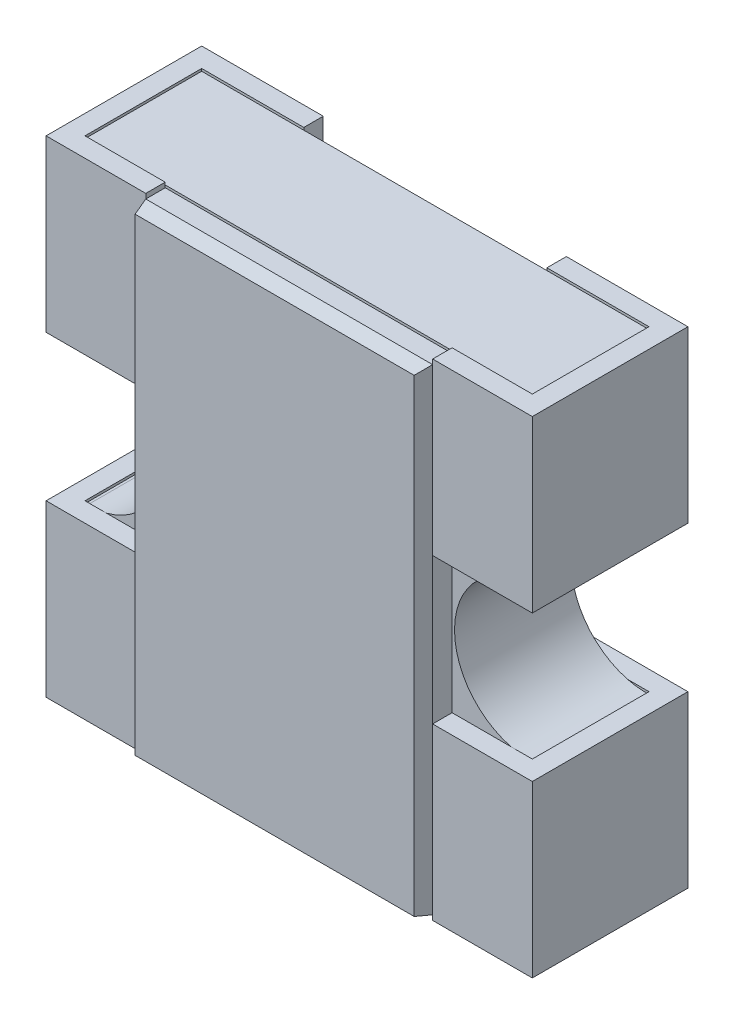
ISO-10303-21;
HEADER;
FILE_DESCRIPTION(('STEP AP214'),'2;1');
FILE_NAME('part.step','',(''),(''),'','','');
FILE_SCHEMA(('AUTOMOTIVE_DESIGN { 1 0 10303 214 1 1 1 1 }'));
ENDSEC;
DATA;
#1=APPLICATION_CONTEXT('core data for automotive mechanical design processes');
#2=APPLICATION_PROTOCOL_DEFINITION('international standard','automotive_design',2000,#1);
#3=PRODUCT_CONTEXT('',#1,'mechanical');
#4=PRODUCT('Part','Part','',(#3));
#5=PRODUCT_RELATED_PRODUCT_CATEGORY('part','',(#4));
#6=PRODUCT_DEFINITION_FORMATION('','',#4);
#7=PRODUCT_DEFINITION_CONTEXT('part definition',#1,'design');
#8=PRODUCT_DEFINITION('design','',#6,#7);
#9=PRODUCT_DEFINITION_SHAPE('','',#8);
#10=(LENGTH_UNIT() NAMED_UNIT(*) SI_UNIT(.MILLI.,.METRE.));
#11=(NAMED_UNIT(*) PLANE_ANGLE_UNIT() SI_UNIT($,.RADIAN.));
#12=(NAMED_UNIT(*) SI_UNIT($,.STERADIAN.) SOLID_ANGLE_UNIT());
#13=UNCERTAINTY_MEASURE_WITH_UNIT(LENGTH_MEASURE(1.E-05),#10,'distance_accuracy_value','');
#14=(GEOMETRIC_REPRESENTATION_CONTEXT(3) GLOBAL_UNCERTAINTY_ASSIGNED_CONTEXT((#13)) GLOBAL_UNIT_ASSIGNED_CONTEXT((#10,
#11,#12)) REPRESENTATION_CONTEXT('',''));
#15=CARTESIAN_POINT('',(0.,0.,0.));
#16=DIRECTION('',(0.,0.,1.));
#17=DIRECTION('',(1.,0.,0.));
#18=AXIS2_PLACEMENT_3D('',#15,#16,#17);
#19=CARTESIAN_POINT('',(-0.455040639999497,-4.06598881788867E-05,0.28));
#20=DIRECTION('',(0.,0.,1.));
#21=DIRECTION('',(-4.37113882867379E-08,0.999999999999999,0.));
#22=AXIS2_PLACEMENT_3D('',#19,#20,#21);
#23=PLANE('',#22);
#24=DIRECTION('',(-4.37113882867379E-08,0.999999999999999,0.));
#25=VECTOR('',#24,1.);
#26=CARTESIAN_POINT('',(0.294959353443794,0.149959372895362,0.28));
#27=LINE('',#26,#25);
#28=CARTESIAN_POINT('',(0.294959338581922,0.489959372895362,0.28));
#29=VERTEX_POINT('',#28);
#30=CARTESIAN_POINT('',(0.294959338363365,0.494959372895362,0.28));
#31=VERTEX_POINT('',#30);
#32=EDGE_CURVE('E11',#29,#31,#27,.T.);
#33=ORIENTED_EDGE('',*,*,#32,.T.);
#34=DIRECTION('',(-0.999999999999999,-4.37113885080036E-08,0.));
#35=VECTOR('',#34,1.);
#36=CARTESIAN_POINT('',(-0.490040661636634,0.494959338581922,0.28));
#37=LINE('',#36,#35);
#38=CARTESIAN_POINT('',(-0.295040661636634,0.494959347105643,0.28));
#39=VERTEX_POINT('',#38);
#40=EDGE_CURVE('E24',#31,#39,#37,.T.);
#41=ORIENTED_EDGE('',*,*,#40,.T.);
#42=DIRECTION('',(-4.37113882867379E-08,0.999999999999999,0.));
#43=VECTOR('',#42,1.);
#44=CARTESIAN_POINT('',(-0.295040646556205,0.149959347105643,0.28));
#45=LINE('',#44,#43);
#46=CARTESIAN_POINT('',(-0.295040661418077,0.489959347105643,0.28));
#47=VERTEX_POINT('',#46);
#48=EDGE_CURVE('E891',#47,#39,#45,.T.);
#49=ORIENTED_EDGE('',*,*,#48,.F.);
#50=DIRECTION('',(-0.999999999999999,-4.37113882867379E-08,0.));
#51=VECTOR('',#50,1.);
#52=CARTESIAN_POINT('',(-0.295040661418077,0.489959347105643,0.28));
#53=LINE('',#52,#51);
#54=EDGE_CURVE('E888',#29,#47,#53,.T.);
#55=ORIENTED_EDGE('',*,*,#54,.F.);
#56=EDGE_LOOP('',(#33,#41,#49,#55));
#57=FACE_BOUND('',#56,.T.);
#58=ADVANCED_FACE('F17',(#57),#23,.T.);
#59=CARTESIAN_POINT('',(-0.455040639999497,-4.06598881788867E-05,0.28));
#60=DIRECTION('',(0.,0.,1.));
#61=DIRECTION('',(-4.37113882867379E-08,0.999999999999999,0.));
#62=AXIS2_PLACEMENT_3D('',#59,#60,#61);
#63=PLANE('',#62);
#64=DIRECTION('',(4.37113882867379E-08,-0.999999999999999,0.));
#65=VECTOR('',#64,1.);
#66=CARTESIAN_POINT('',(-0.295040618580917,-0.490040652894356,0.28));
#67=LINE('',#66,#65);
#68=CARTESIAN_POINT('',(-0.295040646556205,0.149959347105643,0.28));
#69=VERTEX_POINT('',#68);
#70=CARTESIAN_POINT('',(-0.295040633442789,-0.150040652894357,0.28));
#71=VERTEX_POINT('',#70);
#72=EDGE_CURVE('E886',#69,#71,#67,.T.);
#73=ORIENTED_EDGE('',*,*,#72,.F.);
#74=DIRECTION('',(-0.999999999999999,-4.37113882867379E-08,0.));
#75=VECTOR('',#74,1.);
#76=CARTESIAN_POINT('',(-0.295040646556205,0.149959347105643,0.28));
#77=LINE('',#76,#75);
#78=CARTESIAN_POINT('',(-0.415989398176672,0.149959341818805,0.28));
#79=VERTEX_POINT('',#78);
#80=EDGE_CURVE('E884',#69,#79,#77,.T.);
#81=ORIENTED_EDGE('',*,*,#80,.T.);
#82=CARTESIAN_POINT('',(-0.455040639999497,-4.06598881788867E-05,0.28));
#83=DIRECTION('',(0.,0.,-1.));
#84=DIRECTION('',(-4.37113882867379E-08,0.999999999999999,0.));
#85=AXIS2_PLACEMENT_3D('',#82,#83,#84);
#86=CIRCLE('',#85,0.155);
#87=CARTESIAN_POINT('',(-0.415989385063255,-0.150040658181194,0.28));
#88=VERTEX_POINT('',#87);
#89=EDGE_CURVE('E882',#79,#88,#86,.T.);
#90=ORIENTED_EDGE('',*,*,#89,.T.);
#91=DIRECTION('',(-0.999999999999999,-4.37113882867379E-08,0.));
#92=VECTOR('',#91,1.);
#93=CARTESIAN_POINT('',(-0.295040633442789,-0.150040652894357,0.28));
#94=LINE('',#93,#92);
#95=EDGE_CURVE('E879',#71,#88,#94,.T.);
#96=ORIENTED_EDGE('',*,*,#95,.F.);
#97=EDGE_LOOP('',(#73,#81,#90,#96));
#98=FACE_BOUND('',#97,.T.);
#99=ADVANCED_FACE('F946',(#98),#63,.T.);
#100=CARTESIAN_POINT('',(-0.295040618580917,-0.490040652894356,0.28));
#101=DIRECTION('',(-0.999999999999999,-4.37113882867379E-08,0.));
#102=DIRECTION('',(0.,0.,1.));
#103=AXIS2_PLACEMENT_3D('',#100,#101,#102);
#104=PLANE('',#103);
#105=DIRECTION('',(4.37113882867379E-08,-0.999999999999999,0.));
#106=VECTOR('',#105,1.);
#107=CARTESIAN_POINT('',(-0.295040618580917,-0.490040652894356,0.32));
#108=LINE('',#107,#106);
#109=CARTESIAN_POINT('',(-0.295040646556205,0.149959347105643,0.32));
#110=VERTEX_POINT('',#109);
#111=CARTESIAN_POINT('',(-0.295040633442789,-0.150040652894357,0.32));
#112=VERTEX_POINT('',#111);
#113=EDGE_CURVE('E877',#110,#112,#108,.T.);
#114=ORIENTED_EDGE('',*,*,#113,.F.);
#115=DIRECTION('',(0.,0.,-1.));
#116=VECTOR('',#115,1.);
#117=CARTESIAN_POINT('',(-0.295040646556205,0.149959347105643,0.32));
#118=LINE('',#117,#116);
#119=EDGE_CURVE('E874',#110,#69,#118,.T.);
#120=ORIENTED_EDGE('',*,*,#119,.T.);
#121=ORIENTED_EDGE('',*,*,#72,.T.);
#122=DIRECTION('',(0.,0.,-1.));
#123=VECTOR('',#122,1.);
#124=CARTESIAN_POINT('',(-0.295040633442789,-0.150040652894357,0.32));
#125=LINE('',#124,#123);
#126=EDGE_CURVE('E871',#112,#71,#125,.T.);
#127=ORIENTED_EDGE('',*,*,#126,.F.);
#128=EDGE_LOOP('',(#114,#120,#121,#127));
#129=FACE_BOUND('',#128,.T.);
#130=ADVANCED_FACE('F950',(#129),#104,.T.);
#131=CARTESIAN_POINT('',(-0.49004061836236,-0.495040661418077,0.28));
#132=DIRECTION('',(-4.37113885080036E-08,0.999999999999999,0.));
#133=DIRECTION('',(-0.999999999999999,-4.37113885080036E-08,0.));
#134=AXIS2_PLACEMENT_3D('',#131,#132,#133);
#135=PLANE('',#134);
#136=DIRECTION('',(0.,0.,-1.));
#137=VECTOR('',#136,1.);
#138=CARTESIAN_POINT('',(0.45995938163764,-0.495040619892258,0.28));
#139=LINE('',#138,#137);
#140=CARTESIAN_POINT('',(0.45995938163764,-0.495040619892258,0.28));
#141=VERTEX_POINT('',#140);
#142=CARTESIAN_POINT('',(0.45995938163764,-0.495040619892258,0.04));
#143=VERTEX_POINT('',#142);
#144=EDGE_CURVE('E869',#141,#143,#139,.T.);
#145=ORIENTED_EDGE('',*,*,#144,.F.);
#146=DIRECTION('',(0.999999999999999,4.37113885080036E-08,0.));
#147=VECTOR('',#146,1.);
#148=CARTESIAN_POINT('',(-0.49004061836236,-0.495040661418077,0.28));
#149=LINE('',#148,#147);
#150=CARTESIAN_POINT('',(0.29495938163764,-0.495040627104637,0.28));
#151=VERTEX_POINT('',#150);
#152=EDGE_CURVE('E866',#151,#141,#149,.T.);
#153=ORIENTED_EDGE('',*,*,#152,.F.);
#154=DIRECTION('',(0.999999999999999,4.37113885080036E-08,0.));
#155=VECTOR('',#154,1.);
#156=CARTESIAN_POINT('',(-0.49004061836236,-0.495040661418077,0.28));
#157=LINE('',#156,#155);
#158=CARTESIAN_POINT('',(-0.29504061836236,-0.495040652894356,0.28));
#159=VERTEX_POINT('',#158);
#160=EDGE_CURVE('E863',#159,#151,#157,.T.);
#161=ORIENTED_EDGE('',*,*,#160,.F.);
#162=DIRECTION('',(0.999999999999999,4.37113885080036E-08,0.));
#163=VECTOR('',#162,1.);
#164=CARTESIAN_POINT('',(-0.49004061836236,-0.495040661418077,0.28));
#165=LINE('',#164,#163);
#166=CARTESIAN_POINT('',(-0.46004061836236,-0.495040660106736,0.28));
#167=VERTEX_POINT('',#166);
#168=EDGE_CURVE('E860',#167,#159,#165,.T.);
#169=ORIENTED_EDGE('',*,*,#168,.F.);
#170=DIRECTION('',(0.,0.,1.));
#171=VECTOR('',#170,1.);
#172=CARTESIAN_POINT('',(-0.46004061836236,-0.495040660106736,0.28));
#173=LINE('',#172,#171);
#174=CARTESIAN_POINT('',(-0.46004061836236,-0.495040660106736,0.04));
#175=VERTEX_POINT('',#174);
#176=EDGE_CURVE('E857',#175,#167,#173,.T.);
#177=ORIENTED_EDGE('',*,*,#176,.F.);
#178=DIRECTION('',(0.999999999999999,4.37113885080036E-08,0.));
#179=VECTOR('',#178,1.);
#180=CARTESIAN_POINT('',(-0.49004061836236,-0.495040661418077,0.04));
#181=LINE('',#180,#179);
#182=CARTESIAN_POINT('',(-0.25004061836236,-0.495040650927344,0.04));
#183=VERTEX_POINT('',#182);
#184=EDGE_CURVE('E854',#175,#183,#181,.T.);
#185=ORIENTED_EDGE('',*,*,#184,.T.);
#186=DIRECTION('',(0.999999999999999,4.37113885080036E-08,0.));
#187=VECTOR('',#186,1.);
#188=CARTESIAN_POINT('',(-0.49004061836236,-0.495040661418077,0.04));
#189=LINE('',#188,#187);
#190=CARTESIAN_POINT('',(0.24995938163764,-0.49504062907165,0.04));
#191=VERTEX_POINT('',#190);
#192=EDGE_CURVE('E852',#183,#191,#189,.T.);
#193=ORIENTED_EDGE('',*,*,#192,.T.);
#194=DIRECTION('',(-0.999999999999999,-4.37113885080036E-08,0.));
#195=VECTOR('',#194,1.);
#196=CARTESIAN_POINT('',(-0.49004061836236,-0.495040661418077,0.04));
#197=LINE('',#196,#195);
#198=EDGE_CURVE('E849',#143,#191,#197,.T.);
#199=ORIENTED_EDGE('',*,*,#198,.F.);
#200=EDGE_LOOP('',(#145,#153,#161,#169,#177,#185,#193,#199));
#201=FACE_BOUND('',#200,.T.);
#202=ADVANCED_FACE('F955',(#201),#135,.F.);
#203=CARTESIAN_POINT('',(-0.455040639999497,-4.06598881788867E-05,0.28));
#204=DIRECTION('',(0.,0.,1.));
#205=DIRECTION('',(-4.37113882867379E-08,0.999999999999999,0.));
#206=AXIS2_PLACEMENT_3D('',#203,#204,#205);
#207=PLANE('',#206);
#208=ORIENTED_EDGE('',*,*,#160,.T.);
#209=DIRECTION('',(4.37113882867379E-08,-0.999999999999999,0.));
#210=VECTOR('',#209,1.);
#211=CARTESIAN_POINT('',(0.294959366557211,-0.150040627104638,0.28));
#212=LINE('',#211,#210);
#213=CARTESIAN_POINT('',(0.294959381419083,-0.490040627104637,0.28));
#214=VERTEX_POINT('',#213);
#215=EDGE_CURVE('E846',#214,#151,#212,.T.);
#216=ORIENTED_EDGE('',*,*,#215,.F.);
#217=DIRECTION('',(0.999999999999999,4.3711388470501E-08,0.));
#218=VECTOR('',#217,1.);
#219=CARTESIAN_POINT('',(-0.295040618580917,-0.490040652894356,0.28));
#220=LINE('',#219,#218);
#221=CARTESIAN_POINT('',(-0.295040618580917,-0.490040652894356,0.28));
#222=VERTEX_POINT('',#221);
#223=EDGE_CURVE('E844',#222,#214,#220,.T.);
#224=ORIENTED_EDGE('',*,*,#223,.F.);
#225=DIRECTION('',(4.37113882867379E-08,-0.999999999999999,0.));
#226=VECTOR('',#225,1.);
#227=CARTESIAN_POINT('',(-0.295040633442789,-0.150040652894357,0.28));
#228=LINE('',#227,#226);
#229=EDGE_CURVE('E841',#222,#159,#228,.T.);
#230=ORIENTED_EDGE('',*,*,#229,.T.);
#231=EDGE_LOOP('',(#208,#216,#224,#230));
#232=FACE_BOUND('',#231,.T.);
#233=ADVANCED_FACE('F961',(#232),#207,.T.);
#234=CARTESIAN_POINT('',(-0.455040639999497,-4.06598881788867E-05,0.28));
#235=DIRECTION('',(0.,0.,1.));
#236=DIRECTION('',(-4.37113882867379E-08,0.999999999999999,0.));
#237=AXIS2_PLACEMENT_3D('',#234,#235,#236);
#238=PLANE('',#237);
#239=DIRECTION('',(-0.999999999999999,-4.37113882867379E-08,0.));
#240=VECTOR('',#239,1.);
#241=CARTESIAN_POINT('',(0.294959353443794,0.149959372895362,0.28));
#242=LINE('',#241,#240);
#243=CARTESIAN_POINT('',(0.415908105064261,0.1499593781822,0.28));
#244=VERTEX_POINT('',#243);
#245=CARTESIAN_POINT('',(0.294959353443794,0.149959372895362,0.28));
#246=VERTEX_POINT('',#245);
#247=EDGE_CURVE('E838',#244,#246,#242,.T.);
#248=ORIENTED_EDGE('',*,*,#247,.T.);
#249=DIRECTION('',(-4.37113882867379E-08,0.999999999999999,0.));
#250=VECTOR('',#249,1.);
#251=CARTESIAN_POINT('',(0.294959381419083,-0.490040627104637,0.28));
#252=LINE('',#251,#250);
#253=CARTESIAN_POINT('',(0.294959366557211,-0.150040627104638,0.28));
#254=VERTEX_POINT('',#253);
#255=EDGE_CURVE('E836',#254,#246,#252,.T.);
#256=ORIENTED_EDGE('',*,*,#255,.F.);
#257=DIRECTION('',(-0.999999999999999,-4.37113882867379E-08,0.));
#258=VECTOR('',#257,1.);
#259=CARTESIAN_POINT('',(0.294959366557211,-0.150040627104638,0.28));
#260=LINE('',#259,#258);
#261=CARTESIAN_POINT('',(0.415908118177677,-0.1500406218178,0.28));
#262=VERTEX_POINT('',#261);
#263=EDGE_CURVE('E833',#262,#254,#260,.T.);
#264=ORIENTED_EDGE('',*,*,#263,.F.);
#265=CARTESIAN_POINT('',(0.454959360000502,-4.06201108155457E-05,0.28));
#266=DIRECTION('',(0.,0.,-1.));
#267=DIRECTION('',(4.37113882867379E-08,-0.999999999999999,0.));
#268=AXIS2_PLACEMENT_3D('',#265,#266,#267);
#269=CIRCLE('',#268,0.155);
#270=EDGE_CURVE('E831',#262,#244,#269,.T.);
#271=ORIENTED_EDGE('',*,*,#270,.T.);
#272=EDGE_LOOP('',(#248,#256,#264,#271));
#273=FACE_BOUND('',#272,.T.);
#274=ADVANCED_FACE('F965',(#273),#238,.T.);
#275=CARTESIAN_POINT('',(-0.455040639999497,-4.06598881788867E-05,0.04));
#276=DIRECTION('',(0.,0.,1.));
#277=DIRECTION('',(-4.37113882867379E-08,0.999999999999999,0.));
#278=AXIS2_PLACEMENT_3D('',#275,#276,#277);
#279=PLANE('',#278);
#280=DIRECTION('',(-0.999999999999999,-4.37113885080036E-08,0.));
#281=VECTOR('',#280,1.);
#282=CARTESIAN_POINT('',(-0.490040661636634,0.494959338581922,0.04));
#283=LINE('',#282,#281);
#284=CARTESIAN_POINT('',(0.249959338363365,0.49495937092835,0.04));
#285=VERTEX_POINT('',#284);
#286=CARTESIAN_POINT('',(-0.250040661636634,0.494959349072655,0.04));
#287=VERTEX_POINT('',#286);
#288=EDGE_CURVE('E828',#285,#287,#283,.T.);
#289=ORIENTED_EDGE('',*,*,#288,.F.);
#290=DIRECTION('',(-4.37113882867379E-08,0.999999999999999,0.));
#291=VECTOR('',#290,1.);
#292=CARTESIAN_POINT('',(0.249959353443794,0.14995937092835,0.04));
#293=LINE('',#292,#291);
#294=CARTESIAN_POINT('',(0.249959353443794,0.14995937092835,0.04));
#295=VERTEX_POINT('',#294);
#296=EDGE_CURVE('E825',#295,#285,#293,.T.);
#297=ORIENTED_EDGE('',*,*,#296,.F.);
#298=DIRECTION('',(0.999999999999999,4.37113882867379E-08,0.));
#299=VECTOR('',#298,1.);
#300=CARTESIAN_POINT('',(0.459959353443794,0.149959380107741,0.04));
#301=LINE('',#300,#299);
#302=CARTESIAN_POINT('',(0.415908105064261,0.1499593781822,0.04));
#303=VERTEX_POINT('',#302);
#304=EDGE_CURVE('E822',#295,#303,#301,.T.);
#305=ORIENTED_EDGE('',*,*,#304,.T.);
#306=CARTESIAN_POINT('',(0.454959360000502,-4.06201108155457E-05,0.04));
#307=DIRECTION('',(0.,0.,-1.));
#308=DIRECTION('',(4.37113882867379E-08,-0.999999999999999,0.));
#309=AXIS2_PLACEMENT_3D('',#306,#307,#308);
#310=CIRCLE('',#309,0.155);
#311=CARTESIAN_POINT('',(0.415908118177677,-0.1500406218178,0.04));
#312=VERTEX_POINT('',#311);
#313=EDGE_CURVE('E820',#312,#303,#310,.T.);
#314=ORIENTED_EDGE('',*,*,#313,.F.);
#315=DIRECTION('',(0.999999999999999,4.37113882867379E-08,0.));
#316=VECTOR('',#315,1.);
#317=CARTESIAN_POINT('',(0.459959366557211,-0.150040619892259,0.04));
#318=LINE('',#317,#316);
#319=CARTESIAN_POINT('',(0.249959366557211,-0.15004062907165,0.04));
#320=VERTEX_POINT('',#319);
#321=EDGE_CURVE('E817',#320,#312,#318,.T.);
#322=ORIENTED_EDGE('',*,*,#321,.F.);
#323=DIRECTION('',(4.37113882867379E-08,-0.999999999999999,0.));
#324=VECTOR('',#323,1.);
#325=CARTESIAN_POINT('',(0.249959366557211,-0.15004062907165,0.04));
#326=LINE('',#325,#324);
#327=EDGE_CURVE('E814',#320,#191,#326,.T.);
#328=ORIENTED_EDGE('',*,*,#327,.T.);
#329=ORIENTED_EDGE('',*,*,#192,.F.);
#330=DIRECTION('',(4.37113882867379E-08,-0.999999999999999,0.));
#331=VECTOR('',#330,1.);
#332=CARTESIAN_POINT('',(-0.250040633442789,-0.150040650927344,0.04));
#333=LINE('',#332,#331);
#334=CARTESIAN_POINT('',(-0.250040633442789,-0.150040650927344,0.04));
#335=VERTEX_POINT('',#334);
#336=EDGE_CURVE('E811',#335,#183,#333,.T.);
#337=ORIENTED_EDGE('',*,*,#336,.F.);
#338=DIRECTION('',(0.999999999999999,4.37113882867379E-08,0.));
#339=VECTOR('',#338,1.);
#340=CARTESIAN_POINT('',(-0.460040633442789,-0.150040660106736,0.04));
#341=LINE('',#340,#339);
#342=CARTESIAN_POINT('',(-0.415989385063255,-0.150040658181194,0.04));
#343=VERTEX_POINT('',#342);
#344=EDGE_CURVE('E808',#343,#335,#341,.T.);
#345=ORIENTED_EDGE('',*,*,#344,.F.);
#346=CARTESIAN_POINT('',(-0.455040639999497,-4.06598881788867E-05,0.04));
#347=DIRECTION('',(0.,0.,-1.));
#348=DIRECTION('',(-4.37113882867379E-08,0.999999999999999,0.));
#349=AXIS2_PLACEMENT_3D('',#346,#347,#348);
#350=CIRCLE('',#349,0.155);
#351=CARTESIAN_POINT('',(-0.415989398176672,0.149959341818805,0.04));
#352=VERTEX_POINT('',#351);
#353=EDGE_CURVE('E805',#352,#343,#350,.T.);
#354=ORIENTED_EDGE('',*,*,#353,.F.);
#355=DIRECTION('',(0.999999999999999,4.37113882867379E-08,0.));
#356=VECTOR('',#355,1.);
#357=CARTESIAN_POINT('',(-0.460040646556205,0.149959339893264,0.04));
#358=LINE('',#357,#356);
#359=CARTESIAN_POINT('',(-0.250040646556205,0.149959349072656,0.04));
#360=VERTEX_POINT('',#359);
#361=EDGE_CURVE('E803',#352,#360,#358,.T.);
#362=ORIENTED_EDGE('',*,*,#361,.T.);
#363=DIRECTION('',(-4.37113882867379E-08,0.999999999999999,0.));
#364=VECTOR('',#363,1.);
#365=CARTESIAN_POINT('',(-0.250040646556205,0.149959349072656,0.04));
#366=LINE('',#365,#364);
#367=EDGE_CURVE('E801',#360,#287,#366,.T.);
#368=ORIENTED_EDGE('',*,*,#367,.T.);
#369=EDGE_LOOP('',(#289,#297,#305,#314,#322,#328,#329,#337,#345,#354,#362,#368));
#370=FACE_BOUND('',#369,.T.);
#371=ADVANCED_FACE('F969',(#370),#279,.F.);
#372=CARTESIAN_POINT('',(0.489959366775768,-0.155040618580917,0.28));
#373=DIRECTION('',(4.3711389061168E-08,-0.999999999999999,0.));
#374=DIRECTION('',(0.999999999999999,4.3711389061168E-08,0.));
#375=AXIS2_PLACEMENT_3D('',#372,#373,#374);
#376=PLANE('',#375);
#377=DIRECTION('',(0.,0.,1.));
#378=VECTOR('',#377,1.);
#379=CARTESIAN_POINT('',(0.459959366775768,-0.155040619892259,0.28));
#380=LINE('',#379,#378);
#381=CARTESIAN_POINT('',(0.459959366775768,-0.155040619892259,0.04));
#382=VERTEX_POINT('',#381);
#383=CARTESIAN_POINT('',(0.459959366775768,-0.155040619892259,0.28));
#384=VERTEX_POINT('',#383);
#385=EDGE_CURVE('E798',#382,#384,#380,.T.);
#386=ORIENTED_EDGE('',*,*,#385,.F.);
#387=DIRECTION('',(0.999999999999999,4.3711389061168E-08,0.));
#388=VECTOR('',#387,1.);
#389=CARTESIAN_POINT('',(0.489959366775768,-0.155040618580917,0.04));
#390=LINE('',#389,#388);
#391=CARTESIAN_POINT('',(0.454959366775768,-0.155040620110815,0.04));
#392=VERTEX_POINT('',#391);
#393=EDGE_CURVE('E795',#392,#382,#390,.T.);
#394=ORIENTED_EDGE('',*,*,#393,.F.);
#395=DIRECTION('',(0.,0.,-1.));
#396=VECTOR('',#395,1.);
#397=CARTESIAN_POINT('',(0.454959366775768,-0.155040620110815,0.28));
#398=LINE('',#397,#396);
#399=CARTESIAN_POINT('',(0.454959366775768,-0.155040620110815,0.28));
#400=VERTEX_POINT('',#399);
#401=EDGE_CURVE('E792',#400,#392,#398,.T.);
#402=ORIENTED_EDGE('',*,*,#401,.F.);
#403=DIRECTION('',(-0.999999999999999,-4.3711389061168E-08,0.));
#404=VECTOR('',#403,1.);
#405=CARTESIAN_POINT('',(0.489959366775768,-0.155040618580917,0.28));
#406=LINE('',#405,#404);
#407=EDGE_CURVE('E789',#384,#400,#406,.T.);
#408=ORIENTED_EDGE('',*,*,#407,.F.);
#409=EDGE_LOOP('',(#386,#394,#402,#408));
#410=FACE_BOUND('',#409,.T.);
#411=ADVANCED_FACE('F973',(#410),#376,.F.);
#412=CARTESIAN_POINT('',(0.294959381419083,-0.490040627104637,0.28));
#413=DIRECTION('',(0.999999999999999,4.37113882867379E-08,0.));
#414=DIRECTION('',(0.,0.,-1.));
#415=AXIS2_PLACEMENT_3D('',#412,#413,#414);
#416=PLANE('',#415);
#417=DIRECTION('',(0.,0.,1.));
#418=VECTOR('',#417,1.);
#419=CARTESIAN_POINT('',(0.294959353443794,0.149959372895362,0.32));
#420=LINE('',#419,#418);
#421=CARTESIAN_POINT('',(0.294959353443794,0.149959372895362,0.32));
#422=VERTEX_POINT('',#421);
#423=EDGE_CURVE('E787',#246,#422,#420,.T.);
#424=ORIENTED_EDGE('',*,*,#423,.T.);
#425=DIRECTION('',(-4.37113882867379E-08,0.999999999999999,0.));
#426=VECTOR('',#425,1.);
#427=CARTESIAN_POINT('',(0.294959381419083,-0.490040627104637,0.32));
#428=LINE('',#427,#426);
#429=CARTESIAN_POINT('',(0.294959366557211,-0.150040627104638,0.32));
#430=VERTEX_POINT('',#429);
#431=EDGE_CURVE('E784',#430,#422,#428,.T.);
#432=ORIENTED_EDGE('',*,*,#431,.F.);
#433=DIRECTION('',(0.,0.,1.));
#434=VECTOR('',#433,1.);
#435=CARTESIAN_POINT('',(0.294959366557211,-0.150040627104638,0.32));
#436=LINE('',#435,#434);
#437=EDGE_CURVE('E781',#254,#430,#436,.T.);
#438=ORIENTED_EDGE('',*,*,#437,.F.);
#439=ORIENTED_EDGE('',*,*,#255,.T.);
#440=EDGE_LOOP('',(#424,#432,#438,#439));
#441=FACE_BOUND('',#440,.T.);
#442=ADVANCED_FACE('F977',(#441),#416,.T.);
#443=CARTESIAN_POINT('',(-0.490040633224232,-0.155040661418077,0.28));
#444=DIRECTION('',(4.37113875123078E-08,-0.999999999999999,0.));
#445=DIRECTION('',(0.999999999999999,4.37113875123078E-08,0.));
#446=AXIS2_PLACEMENT_3D('',#443,#444,#445);
#447=PLANE('',#446);
#448=DIRECTION('',(0.,0.,-1.));
#449=VECTOR('',#448,1.);
#450=CARTESIAN_POINT('',(-0.460040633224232,-0.155040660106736,0.28));
#451=LINE('',#450,#449);
#452=CARTESIAN_POINT('',(-0.460040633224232,-0.155040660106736,0.28));
#453=VERTEX_POINT('',#452);
#454=CARTESIAN_POINT('',(-0.460040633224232,-0.155040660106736,0.04));
#455=VERTEX_POINT('',#454);
#456=EDGE_CURVE('E778',#453,#455,#451,.T.);
#457=ORIENTED_EDGE('',*,*,#456,.F.);
#458=DIRECTION('',(-0.999999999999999,-4.37113875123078E-08,0.));
#459=VECTOR('',#458,1.);
#460=CARTESIAN_POINT('',(-0.490040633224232,-0.155040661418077,0.28));
#461=LINE('',#460,#459);
#462=CARTESIAN_POINT('',(-0.455040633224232,-0.155040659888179,0.28));
#463=VERTEX_POINT('',#462);
#464=EDGE_CURVE('E775',#463,#453,#461,.T.);
#465=ORIENTED_EDGE('',*,*,#464,.F.);
#466=DIRECTION('',(0.,0.,-1.));
#467=VECTOR('',#466,1.);
#468=CARTESIAN_POINT('',(-0.455040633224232,-0.155040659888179,0.28));
#469=LINE('',#468,#467);
#470=CARTESIAN_POINT('',(-0.455040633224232,-0.155040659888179,0.04));
#471=VERTEX_POINT('',#470);
#472=EDGE_CURVE('E772',#463,#471,#469,.T.);
#473=ORIENTED_EDGE('',*,*,#472,.T.);
#474=DIRECTION('',(-0.999999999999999,-4.37113875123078E-08,0.));
#475=VECTOR('',#474,1.);
#476=CARTESIAN_POINT('',(-0.490040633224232,-0.155040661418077,0.04));
#477=LINE('',#476,#475);
#478=EDGE_CURVE('E770',#471,#455,#477,.T.);
#479=ORIENTED_EDGE('',*,*,#478,.T.);
#480=EDGE_LOOP('',(#457,#465,#473,#479));
#481=FACE_BOUND('',#480,.T.);
#482=ADVANCED_FACE('F981',(#481),#447,.F.);
#483=CARTESIAN_POINT('',(-0.455040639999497,-4.06598881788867E-05,0.28));
#484=DIRECTION('',(0.,0.,-1.));
#485=DIRECTION('',(4.37113882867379E-08,-0.999999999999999,0.));
#486=AXIS2_PLACEMENT_3D('',#483,#484,#485);
#487=CYLINDRICAL_SURFACE('',#486,0.155);
#488=CARTESIAN_POINT('',(-0.455040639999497,-4.06598881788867E-05,0.04));
#489=DIRECTION('',(0.,0.,-1.));
#490=DIRECTION('',(-4.37113882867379E-08,0.999999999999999,0.));
#491=AXIS2_PLACEMENT_3D('',#488,#489,#490);
#492=CIRCLE('',#491,0.155);
#493=CARTESIAN_POINT('',(-0.455040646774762,0.154959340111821,0.04));
#494=VERTEX_POINT('',#493);
#495=EDGE_CURVE('E767',#494,#352,#492,.T.);
#496=ORIENTED_EDGE('',*,*,#495,.T.);
#497=ORIENTED_EDGE('',*,*,#353,.T.);
#498=CARTESIAN_POINT('',(-0.455040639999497,-4.06598881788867E-05,0.04));
#499=DIRECTION('',(0.,0.,-1.));
#500=DIRECTION('',(-4.37113882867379E-08,0.999999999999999,0.));
#501=AXIS2_PLACEMENT_3D('',#498,#499,#500);
#502=CIRCLE('',#501,0.155);
#503=EDGE_CURVE('E764',#343,#471,#502,.T.);
#504=ORIENTED_EDGE('',*,*,#503,.T.);
#505=ORIENTED_EDGE('',*,*,#472,.F.);
#506=CARTESIAN_POINT('',(-0.455040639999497,-4.06598881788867E-05,0.28));
#507=DIRECTION('',(0.,0.,-1.));
#508=DIRECTION('',(-4.37113882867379E-08,0.999999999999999,0.));
#509=AXIS2_PLACEMENT_3D('',#506,#507,#508);
#510=CIRCLE('',#509,0.155);
#511=EDGE_CURVE('E762',#88,#463,#510,.T.);
#512=ORIENTED_EDGE('',*,*,#511,.F.);
#513=ORIENTED_EDGE('',*,*,#89,.F.);
#514=CARTESIAN_POINT('',(-0.455040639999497,-4.06598881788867E-05,0.28));
#515=DIRECTION('',(0.,0.,-1.));
#516=DIRECTION('',(-4.37113882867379E-08,0.999999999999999,0.));
#517=AXIS2_PLACEMENT_3D('',#514,#515,#516);
#518=CIRCLE('',#517,0.155);
#519=CARTESIAN_POINT('',(-0.455040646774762,0.154959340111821,0.28));
#520=VERTEX_POINT('',#519);
#521=EDGE_CURVE('E759',#520,#79,#518,.T.);
#522=ORIENTED_EDGE('',*,*,#521,.F.);
#523=DIRECTION('',(0.,0.,-1.));
#524=VECTOR('',#523,1.);
#525=CARTESIAN_POINT('',(-0.455040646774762,0.154959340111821,0.28));
#526=LINE('',#525,#524);
#527=EDGE_CURVE('E757',#520,#494,#526,.T.);
#528=ORIENTED_EDGE('',*,*,#527,.T.);
#529=EDGE_LOOP('',(#496,#497,#504,#505,#512,#513,#522,#528));
#530=FACE_BOUND('',#529,.T.);
#531=ADVANCED_FACE('F985',(#530),#487,.F.);
#532=CARTESIAN_POINT('',(0.454959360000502,-4.06201108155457E-05,0.28));
#533=DIRECTION('',(0.,0.,-1.));
#534=DIRECTION('',(4.37113882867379E-08,-0.999999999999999,0.));
#535=AXIS2_PLACEMENT_3D('',#532,#533,#534);
#536=CYLINDRICAL_SURFACE('',#535,0.155);
#537=CARTESIAN_POINT('',(0.454959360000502,-4.06201108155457E-05,0.04));
#538=DIRECTION('',(0.,0.,-1.));
#539=DIRECTION('',(4.37113882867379E-08,-0.999999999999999,0.));
#540=AXIS2_PLACEMENT_3D('',#537,#538,#539);
#541=CIRCLE('',#540,0.155);
#542=EDGE_CURVE('E754',#392,#312,#541,.T.);
#543=ORIENTED_EDGE('',*,*,#542,.T.);
#544=ORIENTED_EDGE('',*,*,#313,.T.);
#545=CARTESIAN_POINT('',(0.454959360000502,-4.06201108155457E-05,0.04));
#546=DIRECTION('',(0.,0.,-1.));
#547=DIRECTION('',(-4.37113963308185E-08,0.999999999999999,0.));
#548=AXIS2_PLACEMENT_3D('',#545,#546,#547);
#549=CIRCLE('',#548,0.155);
#550=CARTESIAN_POINT('',(0.454959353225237,0.154959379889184,0.04));
#551=VERTEX_POINT('',#550);
#552=EDGE_CURVE('E751',#303,#551,#549,.T.);
#553=ORIENTED_EDGE('',*,*,#552,.T.);
#554=DIRECTION('',(0.,0.,-1.));
#555=VECTOR('',#554,1.);
#556=CARTESIAN_POINT('',(0.454959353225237,0.154959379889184,0.28));
#557=LINE('',#556,#555);
#558=CARTESIAN_POINT('',(0.454959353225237,0.154959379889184,0.28));
#559=VERTEX_POINT('',#558);
#560=EDGE_CURVE('E748',#559,#551,#557,.T.);
#561=ORIENTED_EDGE('',*,*,#560,.F.);
#562=CARTESIAN_POINT('',(0.454959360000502,-4.06201108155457E-05,0.28));
#563=DIRECTION('',(0.,0.,1.));
#564=DIRECTION('',(4.37113882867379E-08,-0.999999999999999,0.));
#565=AXIS2_PLACEMENT_3D('',#562,#563,#564);
#566=CIRCLE('',#565,0.155);
#567=EDGE_CURVE('E745',#559,#244,#566,.T.);
#568=ORIENTED_EDGE('',*,*,#567,.T.);
#569=ORIENTED_EDGE('',*,*,#270,.F.);
#570=CARTESIAN_POINT('',(0.454959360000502,-4.06201108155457E-05,0.28));
#571=DIRECTION('',(0.,0.,-1.));
#572=DIRECTION('',(4.37113882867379E-08,-0.999999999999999,0.));
#573=AXIS2_PLACEMENT_3D('',#570,#571,#572);
#574=CIRCLE('',#573,0.155);
#575=EDGE_CURVE('E742',#400,#262,#574,.T.);
#576=ORIENTED_EDGE('',*,*,#575,.F.);
#577=ORIENTED_EDGE('',*,*,#401,.T.);
#578=EDGE_LOOP('',(#543,#544,#553,#561,#568,#569,#576,#577));
#579=FACE_BOUND('',#578,.T.);
#580=ADVANCED_FACE('F989',(#579),#536,.F.);
#581=CARTESIAN_POINT('',(0.489959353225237,0.154959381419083,0.28));
#582=DIRECTION('',(-4.37113882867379E-08,0.999999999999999,0.));
#583=DIRECTION('',(0.,0.,-1.));
#584=AXIS2_PLACEMENT_3D('',#581,#582,#583);
#585=PLANE('',#584);
#586=DIRECTION('',(0.999999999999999,4.37113882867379E-08,0.));
#587=VECTOR('',#586,1.);
#588=CARTESIAN_POINT('',(0.489959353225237,0.154959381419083,0.04));
#589=LINE('',#588,#587);
#590=CARTESIAN_POINT('',(0.459959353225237,0.154959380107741,0.04));
#591=VERTEX_POINT('',#590);
#592=EDGE_CURVE('E739',#551,#591,#589,.T.);
#593=ORIENTED_EDGE('',*,*,#592,.T.);
#594=DIRECTION('',(0.,0.,1.));
#595=VECTOR('',#594,1.);
#596=CARTESIAN_POINT('',(0.459959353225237,0.154959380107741,0.28));
#597=LINE('',#596,#595);
#598=CARTESIAN_POINT('',(0.459959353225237,0.154959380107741,0.28));
#599=VERTEX_POINT('',#598);
#600=EDGE_CURVE('E737',#591,#599,#597,.T.);
#601=ORIENTED_EDGE('',*,*,#600,.T.);
#602=DIRECTION('',(0.999999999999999,4.37113882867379E-08,0.));
#603=VECTOR('',#602,1.);
#604=CARTESIAN_POINT('',(0.489959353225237,0.154959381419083,0.28));
#605=LINE('',#604,#603);
#606=EDGE_CURVE('E734',#559,#599,#605,.T.);
#607=ORIENTED_EDGE('',*,*,#606,.F.);
#608=ORIENTED_EDGE('',*,*,#560,.T.);
#609=EDGE_LOOP('',(#593,#601,#607,#608));
#610=FACE_BOUND('',#609,.T.);
#611=ADVANCED_FACE('F993',(#610),#585,.F.);
#612=CARTESIAN_POINT('',(-0.490040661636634,0.494959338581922,0.28));
#613=DIRECTION('',(4.37113885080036E-08,-0.999999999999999,0.));
#614=DIRECTION('',(0.999999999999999,4.37113885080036E-08,0.));
#615=AXIS2_PLACEMENT_3D('',#612,#613,#614);
#616=PLANE('',#615);
#617=DIRECTION('',(-0.999999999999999,-4.37113885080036E-08,0.));
#618=VECTOR('',#617,1.);
#619=CARTESIAN_POINT('',(-0.490040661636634,0.494959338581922,0.28));
#620=LINE('',#619,#618);
#621=CARTESIAN_POINT('',(0.459959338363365,0.494959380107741,0.28));
#622=VERTEX_POINT('',#621);
#623=EDGE_CURVE('E731',#622,#31,#620,.T.);
#624=ORIENTED_EDGE('',*,*,#623,.F.);
#625=DIRECTION('',(0.,0.,-1.));
#626=VECTOR('',#625,1.);
#627=CARTESIAN_POINT('',(0.459959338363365,0.494959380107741,0.28));
#628=LINE('',#627,#626);
#629=CARTESIAN_POINT('',(0.459959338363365,0.494959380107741,0.04));
#630=VERTEX_POINT('',#629);
#631=EDGE_CURVE('E728',#622,#630,#628,.T.);
#632=ORIENTED_EDGE('',*,*,#631,.T.);
#633=DIRECTION('',(-0.999999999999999,-4.37113885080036E-08,0.));
#634=VECTOR('',#633,1.);
#635=CARTESIAN_POINT('',(-0.490040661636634,0.494959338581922,0.04));
#636=LINE('',#635,#634);
#637=EDGE_CURVE('E725',#630,#285,#636,.T.);
#638=ORIENTED_EDGE('',*,*,#637,.T.);
#639=ORIENTED_EDGE('',*,*,#288,.T.);
#640=DIRECTION('',(-0.999999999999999,-4.37113885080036E-08,0.));
#641=VECTOR('',#640,1.);
#642=CARTESIAN_POINT('',(-0.490040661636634,0.494959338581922,0.04));
#643=LINE('',#642,#641);
#644=CARTESIAN_POINT('',(-0.460040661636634,0.494959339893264,0.04));
#645=VERTEX_POINT('',#644);
#646=EDGE_CURVE('E723',#287,#645,#643,.T.);
#647=ORIENTED_EDGE('',*,*,#646,.T.);
#648=DIRECTION('',(0.,0.,1.));
#649=VECTOR('',#648,1.);
#650=CARTESIAN_POINT('',(-0.460040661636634,0.494959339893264,0.28));
#651=LINE('',#650,#649);
#652=CARTESIAN_POINT('',(-0.460040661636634,0.494959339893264,0.28));
#653=VERTEX_POINT('',#652);
#654=EDGE_CURVE('E720',#645,#653,#651,.T.);
#655=ORIENTED_EDGE('',*,*,#654,.T.);
#656=DIRECTION('',(0.999999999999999,4.37113885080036E-08,0.));
#657=VECTOR('',#656,1.);
#658=CARTESIAN_POINT('',(-0.490040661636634,0.494959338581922,0.28));
#659=LINE('',#658,#657);
#660=EDGE_CURVE('E717',#653,#39,#659,.T.);
#661=ORIENTED_EDGE('',*,*,#660,.T.);
#662=ORIENTED_EDGE('',*,*,#40,.F.);
#663=EDGE_LOOP('',(#624,#632,#638,#639,#647,#655,#661,#662));
#664=FACE_BOUND('',#663,.T.);
#665=ADVANCED_FACE('F902',(#664),#616,.F.);
#666=CARTESIAN_POINT('',(-0.490040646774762,0.154959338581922,0.28));
#667=DIRECTION('',(-4.3711389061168E-08,0.999999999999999,0.));
#668=DIRECTION('',(-0.999999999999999,-4.3711389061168E-08,0.));
#669=AXIS2_PLACEMENT_3D('',#666,#667,#668);
#670=PLANE('',#669);
#671=DIRECTION('',(-0.999999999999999,-4.3711389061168E-08,0.));
#672=VECTOR('',#671,1.);
#673=CARTESIAN_POINT('',(-0.490040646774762,0.154959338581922,0.28));
#674=LINE('',#673,#672);
#675=CARTESIAN_POINT('',(-0.460040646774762,0.154959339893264,0.28));
#676=VERTEX_POINT('',#675);
#677=EDGE_CURVE('E714',#520,#676,#674,.T.);
#678=ORIENTED_EDGE('',*,*,#677,.T.);
#679=DIRECTION('',(0.,0.,-1.));
#680=VECTOR('',#679,1.);
#681=CARTESIAN_POINT('',(-0.460040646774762,0.154959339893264,0.28));
#682=LINE('',#681,#680);
#683=CARTESIAN_POINT('',(-0.460040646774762,0.154959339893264,0.04));
#684=VERTEX_POINT('',#683);
#685=EDGE_CURVE('E711',#676,#684,#682,.T.);
#686=ORIENTED_EDGE('',*,*,#685,.T.);
#687=DIRECTION('',(0.999999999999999,4.3711389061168E-08,0.));
#688=VECTOR('',#687,1.);
#689=CARTESIAN_POINT('',(-0.490040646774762,0.154959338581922,0.04));
#690=LINE('',#689,#688);
#691=EDGE_CURVE('E708',#684,#494,#690,.T.);
#692=ORIENTED_EDGE('',*,*,#691,.T.);
#693=ORIENTED_EDGE('',*,*,#527,.F.);
#694=EDGE_LOOP('',(#678,#686,#692,#693));
#695=FACE_BOUND('',#694,.T.);
#696=ADVANCED_FACE('F942',(#695),#670,.F.);
#697=CARTESIAN_POINT('',(-0.295040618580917,-0.490040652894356,0.28));
#698=DIRECTION('',(4.3711388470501E-08,-0.999999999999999,0.));
#699=DIRECTION('',(0.999999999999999,4.3711388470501E-08,0.));
#700=AXIS2_PLACEMENT_3D('',#697,#698,#699);
#701=PLANE('',#700);
#702=DIRECTION('',(0.999999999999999,4.3711388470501E-08,0.));
#703=VECTOR('',#702,1.);
#704=CARTESIAN_POINT('',(-0.295040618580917,-0.490040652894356,0.32));
#705=LINE('',#704,#703);
#706=CARTESIAN_POINT('',(-0.295040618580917,-0.490040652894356,0.32));
#707=VERTEX_POINT('',#706);
#708=CARTESIAN_POINT('',(0.294959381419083,-0.490040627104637,0.32));
#709=VERTEX_POINT('',#708);
#710=EDGE_CURVE('E706',#707,#709,#705,.T.);
#711=ORIENTED_EDGE('',*,*,#710,.F.);
#712=DIRECTION('',(0.,0.,1.));
#713=VECTOR('',#712,1.);
#714=CARTESIAN_POINT('',(-0.295040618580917,-0.490040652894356,0.28));
#715=LINE('',#714,#713);
#716=EDGE_CURVE('E703',#222,#707,#715,.T.);
#717=ORIENTED_EDGE('',*,*,#716,.F.);
#718=ORIENTED_EDGE('',*,*,#223,.T.);
#719=DIRECTION('',(0.,0.,1.));
#720=VECTOR('',#719,1.);
#721=CARTESIAN_POINT('',(0.294959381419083,-0.490040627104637,0.28));
#722=LINE('',#721,#720);
#723=EDGE_CURVE('E700',#214,#709,#722,.T.);
#724=ORIENTED_EDGE('',*,*,#723,.T.);
#725=EDGE_LOOP('',(#711,#717,#718,#724));
#726=FACE_BOUND('',#725,.T.);
#727=ADVANCED_FACE('F932',(#726),#701,.T.);
#728=CARTESIAN_POINT('',(-0.295040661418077,0.489959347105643,0.28));
#729=DIRECTION('',(-4.37113882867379E-08,0.999999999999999,0.));
#730=DIRECTION('',(0.,0.,-1.));
#731=AXIS2_PLACEMENT_3D('',#728,#729,#730);
#732=PLANE('',#731);
#733=DIRECTION('',(-0.999999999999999,-4.37113882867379E-08,0.));
#734=VECTOR('',#733,1.);
#735=CARTESIAN_POINT('',(-0.295040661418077,0.489959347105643,0.32));
#736=LINE('',#735,#734);
#737=CARTESIAN_POINT('',(0.294959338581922,0.489959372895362,0.32));
#738=VERTEX_POINT('',#737);
#739=CARTESIAN_POINT('',(-0.295040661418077,0.489959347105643,0.32));
#740=VERTEX_POINT('',#739);
#741=EDGE_CURVE('E697',#738,#740,#736,.T.);
#742=ORIENTED_EDGE('',*,*,#741,.F.);
#743=DIRECTION('',(0.,0.,1.));
#744=VECTOR('',#743,1.);
#745=CARTESIAN_POINT('',(0.294959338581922,0.489959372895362,0.28));
#746=LINE('',#745,#744);
#747=EDGE_CURVE('E395',#29,#738,#746,.T.);
#748=ORIENTED_EDGE('',*,*,#747,.F.);
#749=ORIENTED_EDGE('',*,*,#54,.T.);
#750=DIRECTION('',(0.,0.,1.));
#751=VECTOR('',#750,1.);
#752=CARTESIAN_POINT('',(-0.295040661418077,0.489959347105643,0.28));
#753=LINE('',#752,#751);
#754=EDGE_CURVE('E693',#47,#740,#753,.T.);
#755=ORIENTED_EDGE('',*,*,#754,.T.);
#756=EDGE_LOOP('',(#742,#748,#749,#755));
#757=FACE_BOUND('',#756,.T.);
#758=ADVANCED_FACE('F929',(#757),#732,.T.);
#759=CARTESIAN_POINT('',(-0.295040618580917,-0.490040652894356,0.32));
#760=DIRECTION('',(4.22219590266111E-08,-0.965925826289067,0.258819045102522));
#761=DIRECTION('',(-1.1313339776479E-08,0.258819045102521,0.965925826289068));
#762=AXIS2_PLACEMENT_3D('',#759,#760,#761);
#763=PLANE('',#762);
#764=ORIENTED_EDGE('',*,*,#710,.T.);
#765=DIRECTION('',(0.25056281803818,-0.250562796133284,-0.935113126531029));
#766=VECTOR('',#765,1.);
#767=CARTESIAN_POINT('',(0.294959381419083,-0.490040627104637,0.32));
#768=LINE('',#767,#766);
#769=CARTESIAN_POINT('',(0.286920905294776,-0.482002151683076,0.35));
#770=VERTEX_POINT('',#769);
#771=EDGE_CURVE('E690',#770,#709,#768,.T.);
#772=ORIENTED_EDGE('',*,*,#771,.F.);
#773=DIRECTION('',(0.999999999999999,4.3711388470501E-08,0.));
#774=VECTOR('',#773,1.);
#775=CARTESIAN_POINT('',(-0.29504061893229,-0.482002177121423,0.35));
#776=LINE('',#775,#774);
#777=CARTESIAN_POINT('',(-0.287002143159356,-0.48200217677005,0.35));
#778=VERTEX_POINT('',#777);
#779=EDGE_CURVE('E687',#778,#770,#776,.T.);
#780=ORIENTED_EDGE('',*,*,#779,.F.);
#781=DIRECTION('',(-0.250562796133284,-0.25056281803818,-0.935113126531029));
#782=VECTOR('',#781,1.);
#783=CARTESIAN_POINT('',(-0.295040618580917,-0.490040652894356,0.32));
#784=LINE('',#783,#782);
#785=EDGE_CURVE('E684',#778,#707,#784,.T.);
#786=ORIENTED_EDGE('',*,*,#785,.T.);
#787=EDGE_LOOP('',(#764,#772,#780,#786));
#788=FACE_BOUND('',#787,.T.);
#789=ADVANCED_FACE('F931',(#788),#763,.T.);
#790=CARTESIAN_POINT('',(0.294959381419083,-0.490040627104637,0.32));
#791=DIRECTION('',(0.965925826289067,4.22219588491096E-08,0.258819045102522));
#792=DIRECTION('',(0.258819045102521,1.1313339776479E-08,-0.965925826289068));
#793=AXIS2_PLACEMENT_3D('',#790,#791,#792);
#794=PLANE('',#793);
#795=DIRECTION('',(-4.37113882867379E-08,0.999999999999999,0.));
#796=VECTOR('',#795,1.);
#797=CARTESIAN_POINT('',(0.294959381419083,-0.490040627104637,0.32));
#798=LINE('',#797,#796);
#799=EDGE_CURVE('E681',#709,#430,#798,.T.);
#800=ORIENTED_EDGE('',*,*,#799,.T.);
#801=ORIENTED_EDGE('',*,*,#431,.T.);
#802=DIRECTION('',(-4.37113882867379E-08,0.999999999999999,0.));
#803=VECTOR('',#802,1.);
#804=CARTESIAN_POINT('',(0.294959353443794,0.149959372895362,0.32));
#805=LINE('',#804,#803);
#806=EDGE_CURVE('E679',#422,#738,#805,.T.);
#807=ORIENTED_EDGE('',*,*,#806,.T.);
#808=DIRECTION('',(0.250562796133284,0.25056281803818,-0.935113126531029));
#809=VECTOR('',#808,1.);
#810=CARTESIAN_POINT('',(0.257918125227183,0.452918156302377,0.458239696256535));
#811=LINE('',#810,#809);
#812=CARTESIAN_POINT('',(0.286920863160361,0.481920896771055,0.35));
#813=VERTEX_POINT('',#812);
#814=EDGE_CURVE('E676',#813,#738,#811,.T.);
#815=ORIENTED_EDGE('',*,*,#814,.F.);
#816=DIRECTION('',(-4.37113882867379E-08,0.999999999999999,0.));
#817=VECTOR('',#816,1.);
#818=CARTESIAN_POINT('',(0.286920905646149,-0.49004062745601,0.35));
#819=LINE('',#818,#817);
#820=EDGE_CURVE('E674',#770,#813,#819,.T.);
#821=ORIENTED_EDGE('',*,*,#820,.F.);
#822=ORIENTED_EDGE('',*,*,#771,.T.);
#823=EDGE_LOOP('',(#800,#801,#807,#815,#821,#822));
#824=FACE_BOUND('',#823,.T.);
#825=ADVANCED_FACE('F939',(#824),#794,.T.);
#826=CARTESIAN_POINT('',(-0.295040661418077,0.489959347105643,0.32));
#827=DIRECTION('',(-4.22219588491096E-08,0.965925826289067,0.258819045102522));
#828=DIRECTION('',(-1.1313339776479E-08,0.258819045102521,-0.965925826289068));
#829=AXIS2_PLACEMENT_3D('',#826,#827,#828);
#830=PLANE('',#829);
#831=ORIENTED_EDGE('',*,*,#741,.T.);
#832=DIRECTION('',(-0.25056281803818,0.250562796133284,-0.935113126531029));
#833=VECTOR('',#832,1.);
#834=CARTESIAN_POINT('',(-0.233514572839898,0.428433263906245,0.549618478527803));
#835=LINE('',#834,#833);
#836=CARTESIAN_POINT('',(-0.28700218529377,0.481920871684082,0.35));
#837=VERTEX_POINT('',#836);
#838=EDGE_CURVE('E671',#837,#740,#835,.T.);
#839=ORIENTED_EDGE('',*,*,#838,.F.);
#840=DIRECTION('',(-0.999999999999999,-4.37113882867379E-08,0.));
#841=VECTOR('',#840,1.);
#842=CARTESIAN_POINT('',(-0.295040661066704,0.481920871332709,0.35));
#843=LINE('',#842,#841);
#844=EDGE_CURVE('E668',#813,#837,#843,.T.);
#845=ORIENTED_EDGE('',*,*,#844,.F.);
#846=ORIENTED_EDGE('',*,*,#814,.T.);
#847=EDGE_LOOP('',(#831,#839,#845,#846));
#848=FACE_BOUND('',#847,.T.);
#849=ADVANCED_FACE('F924',(#848),#830,.T.);
#850=CARTESIAN_POINT('',(-0.295040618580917,-0.490040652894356,0.32));
#851=DIRECTION('',(-0.965925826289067,-4.22219588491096E-08,0.258819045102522));
#852=DIRECTION('',(0.258819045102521,1.1313339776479E-08,0.965925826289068));
#853=AXIS2_PLACEMENT_3D('',#850,#851,#852);
#854=PLANE('',#853);
#855=DIRECTION('',(4.37113882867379E-08,-0.999999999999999,0.));
#856=VECTOR('',#855,1.);
#857=CARTESIAN_POINT('',(-0.295040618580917,-0.490040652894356,0.32));
#858=LINE('',#857,#856);
#859=EDGE_CURVE('E665',#740,#110,#858,.T.);
#860=ORIENTED_EDGE('',*,*,#859,.T.);
#861=ORIENTED_EDGE('',*,*,#113,.T.);
#862=DIRECTION('',(4.37113882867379E-08,-0.999999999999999,0.));
#863=VECTOR('',#862,1.);
#864=CARTESIAN_POINT('',(-0.295040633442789,-0.150040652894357,0.32));
#865=LINE('',#864,#863);
#866=EDGE_CURVE('E662',#112,#707,#865,.T.);
#867=ORIENTED_EDGE('',*,*,#866,.T.);
#868=ORIENTED_EDGE('',*,*,#785,.F.);
#869=DIRECTION('',(4.37113882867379E-08,-0.999999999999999,0.));
#870=VECTOR('',#869,1.);
#871=CARTESIAN_POINT('',(-0.287002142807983,-0.490040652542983,0.35));
#872=LINE('',#871,#870);
#873=EDGE_CURVE('E659',#837,#778,#872,.T.);
#874=ORIENTED_EDGE('',*,*,#873,.F.);
#875=ORIENTED_EDGE('',*,*,#838,.T.);
#876=EDGE_LOOP('',(#860,#861,#867,#868,#874,#875));
#877=FACE_BOUND('',#876,.T.);
#878=ADVANCED_FACE('F920',(#877),#854,.T.);
#879=CARTESIAN_POINT('',(0.294959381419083,-0.490040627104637,0.35));
#880=DIRECTION('',(0.,0.,1.));
#881=DIRECTION('',(-4.37113882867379E-08,0.999999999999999,0.));
#882=AXIS2_PLACEMENT_3D('',#879,#880,#881);
#883=PLANE('',#882);
#884=ORIENTED_EDGE('',*,*,#779,.T.);
#885=ORIENTED_EDGE('',*,*,#820,.T.);
#886=ORIENTED_EDGE('',*,*,#844,.T.);
#887=ORIENTED_EDGE('',*,*,#873,.T.);
#888=EDGE_LOOP('',(#884,#885,#886,#887));
#889=FACE_BOUND('',#888,.T.);
#890=ADVANCED_FACE('F1159',(#889),#883,.T.);
#891=CARTESIAN_POINT('',(-0.460040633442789,-0.150040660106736,0.04));
#892=DIRECTION('',(0.,0.,-1.));
#893=DIRECTION('',(4.37113882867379E-08,-0.999999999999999,0.));
#894=AXIS2_PLACEMENT_3D('',#891,#892,#893);
#895=PLANE('',#894);
#896=ORIENTED_EDGE('',*,*,#478,.F.);
#897=ORIENTED_EDGE('',*,*,#503,.F.);
#898=DIRECTION('',(0.999999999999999,4.37113882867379E-08,0.));
#899=VECTOR('',#898,1.);
#900=CARTESIAN_POINT('',(-0.460040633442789,-0.150040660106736,0.04));
#901=LINE('',#900,#899);
#902=CARTESIAN_POINT('',(-0.460040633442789,-0.150040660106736,0.04));
#903=VERTEX_POINT('',#902);
#904=EDGE_CURVE('E656',#903,#343,#901,.T.);
#905=ORIENTED_EDGE('',*,*,#904,.F.);
#906=DIRECTION('',(4.37113882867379E-08,-0.999999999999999,0.));
#907=VECTOR('',#906,1.);
#908=CARTESIAN_POINT('',(-0.460040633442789,-0.150040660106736,0.04));
#909=LINE('',#908,#907);
#910=EDGE_CURVE('E653',#903,#455,#909,.T.);
#911=ORIENTED_EDGE('',*,*,#910,.T.);
#912=EDGE_LOOP('',(#896,#897,#905,#911));
#913=FACE_BOUND('',#912,.T.);
#914=ADVANCED_FACE('F1155',(#913),#895,.F.);
#915=CARTESIAN_POINT('',(-0.460040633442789,-0.150040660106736,0.04));
#916=DIRECTION('',(0.,0.,-1.));
#917=DIRECTION('',(4.37113882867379E-08,-0.999999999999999,0.));
#918=AXIS2_PLACEMENT_3D('',#915,#916,#917);
#919=PLANE('',#918);
#920=DIRECTION('',(4.37113882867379E-08,-0.999999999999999,0.));
#921=VECTOR('',#920,1.);
#922=CARTESIAN_POINT('',(-0.250040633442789,-0.150040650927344,0.04));
#923=LINE('',#922,#921);
#924=CARTESIAN_POINT('',(-0.250040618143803,-0.500040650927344,0.04));
#925=VERTEX_POINT('',#924);
#926=EDGE_CURVE('E650',#183,#925,#923,.T.);
#927=ORIENTED_EDGE('',*,*,#926,.F.);
#928=ORIENTED_EDGE('',*,*,#184,.F.);
#929=DIRECTION('',(4.37113882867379E-08,-0.999999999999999,0.));
#930=VECTOR('',#929,1.);
#931=CARTESIAN_POINT('',(-0.460040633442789,-0.150040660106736,0.04));
#932=LINE('',#931,#930);
#933=CARTESIAN_POINT('',(-0.460040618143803,-0.500040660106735,0.04));
#934=VERTEX_POINT('',#933);
#935=EDGE_CURVE('E647',#175,#934,#932,.T.);
#936=ORIENTED_EDGE('',*,*,#935,.T.);
#937=DIRECTION('',(0.999999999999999,4.37113882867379E-08,0.));
#938=VECTOR('',#937,1.);
#939=CARTESIAN_POINT('',(-0.460040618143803,-0.500040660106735,0.04));
#940=LINE('',#939,#938);
#941=EDGE_CURVE('E644',#934,#925,#940,.T.);
#942=ORIENTED_EDGE('',*,*,#941,.T.);
#943=EDGE_LOOP('',(#927,#928,#936,#942));
#944=FACE_BOUND('',#943,.T.);
#945=ADVANCED_FACE('F1151',(#944),#919,.F.);
#946=CARTESIAN_POINT('',(-0.460040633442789,-0.150040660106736,0.28));
#947=DIRECTION('',(-0.999999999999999,-4.37113882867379E-08,0.));
#948=DIRECTION('',(0.,0.,1.));
#949=AXIS2_PLACEMENT_3D('',#946,#947,#948);
#950=PLANE('',#949);
#951=DIRECTION('',(4.37113882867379E-08,-0.999999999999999,0.));
#952=VECTOR('',#951,1.);
#953=CARTESIAN_POINT('',(-0.460040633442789,-0.150040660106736,0.28));
#954=LINE('',#953,#952);
#955=CARTESIAN_POINT('',(-0.460040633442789,-0.150040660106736,0.28));
#956=VERTEX_POINT('',#955);
#957=EDGE_CURVE('E641',#956,#453,#954,.T.);
#958=ORIENTED_EDGE('',*,*,#957,.T.);
#959=ORIENTED_EDGE('',*,*,#456,.T.);
#960=ORIENTED_EDGE('',*,*,#910,.F.);
#961=DIRECTION('',(0.,0.,-1.));
#962=VECTOR('',#961,1.);
#963=CARTESIAN_POINT('',(-0.460040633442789,-0.150040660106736,0.28));
#964=LINE('',#963,#962);
#965=EDGE_CURVE('E639',#956,#903,#964,.T.);
#966=ORIENTED_EDGE('',*,*,#965,.F.);
#967=EDGE_LOOP('',(#958,#959,#960,#966));
#968=FACE_BOUND('',#967,.T.);
#969=ADVANCED_FACE('F1147',(#968),#950,.F.);
#970=CARTESIAN_POINT('',(-0.460040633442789,-0.150040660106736,0.28));
#971=DIRECTION('',(-0.999999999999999,-4.37113882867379E-08,0.));
#972=DIRECTION('',(0.,0.,1.));
#973=AXIS2_PLACEMENT_3D('',#970,#971,#972);
#974=PLANE('',#973);
#975=ORIENTED_EDGE('',*,*,#935,.F.);
#976=ORIENTED_EDGE('',*,*,#176,.T.);
#977=DIRECTION('',(4.37113882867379E-08,-0.999999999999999,0.));
#978=VECTOR('',#977,1.);
#979=CARTESIAN_POINT('',(-0.460040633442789,-0.150040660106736,0.28));
#980=LINE('',#979,#978);
#981=CARTESIAN_POINT('',(-0.460040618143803,-0.500040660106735,0.28));
#982=VERTEX_POINT('',#981);
#983=EDGE_CURVE('E637',#167,#982,#980,.T.);
#984=ORIENTED_EDGE('',*,*,#983,.T.);
#985=DIRECTION('',(0.,0.,-1.));
#986=VECTOR('',#985,1.);
#987=CARTESIAN_POINT('',(-0.460040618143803,-0.500040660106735,0.28));
#988=LINE('',#987,#986);
#989=EDGE_CURVE('E635',#982,#934,#988,.T.);
#990=ORIENTED_EDGE('',*,*,#989,.T.);
#991=EDGE_LOOP('',(#975,#976,#984,#990));
#992=FACE_BOUND('',#991,.T.);
#993=ADVANCED_FACE('F1143',(#992),#974,.F.);
#994=CARTESIAN_POINT('',(-0.295040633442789,-0.150040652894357,0.28));
#995=DIRECTION('',(0.,0.,1.));
#996=DIRECTION('',(-4.37113882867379E-08,0.999999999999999,0.));
#997=AXIS2_PLACEMENT_3D('',#994,#995,#996);
#998=PLANE('',#997);
#999=DIRECTION('',(-0.999999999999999,-4.37113882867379E-08,0.));
#1000=VECTOR('',#999,1.);
#1001=CARTESIAN_POINT('',(-0.295040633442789,-0.150040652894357,0.28));
#1002=LINE('',#1001,#1000);
#1003=EDGE_CURVE('E632',#88,#956,#1002,.T.);
#1004=ORIENTED_EDGE('',*,*,#1003,.F.);
#1005=ORIENTED_EDGE('',*,*,#511,.T.);
#1006=ORIENTED_EDGE('',*,*,#464,.T.);
#1007=ORIENTED_EDGE('',*,*,#957,.F.);
#1008=EDGE_LOOP('',(#1004,#1005,#1006,#1007));
#1009=FACE_BOUND('',#1008,.T.);
#1010=ADVANCED_FACE('F1139',(#1009),#998,.F.);
#1011=CARTESIAN_POINT('',(-0.295040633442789,-0.150040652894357,0.28));
#1012=DIRECTION('',(0.,0.,1.));
#1013=DIRECTION('',(-4.37113882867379E-08,0.999999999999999,0.));
#1014=AXIS2_PLACEMENT_3D('',#1011,#1012,#1013);
#1015=PLANE('',#1014);
#1016=ORIENTED_EDGE('',*,*,#983,.F.);
#1017=ORIENTED_EDGE('',*,*,#168,.T.);
#1018=DIRECTION('',(4.37113882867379E-08,-0.999999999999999,0.));
#1019=VECTOR('',#1018,1.);
#1020=CARTESIAN_POINT('',(-0.295040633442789,-0.150040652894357,0.28));
#1021=LINE('',#1020,#1019);
#1022=CARTESIAN_POINT('',(-0.295040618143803,-0.500040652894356,0.28));
#1023=VERTEX_POINT('',#1022);
#1024=EDGE_CURVE('E630',#159,#1023,#1021,.T.);
#1025=ORIENTED_EDGE('',*,*,#1024,.T.);
#1026=DIRECTION('',(-0.999999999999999,-4.37113882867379E-08,0.));
#1027=VECTOR('',#1026,1.);
#1028=CARTESIAN_POINT('',(-0.295040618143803,-0.500040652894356,0.28));
#1029=LINE('',#1028,#1027);
#1030=EDGE_CURVE('E627',#1023,#982,#1029,.T.);
#1031=ORIENTED_EDGE('',*,*,#1030,.T.);
#1032=EDGE_LOOP('',(#1016,#1017,#1025,#1031));
#1033=FACE_BOUND('',#1032,.T.);
#1034=ADVANCED_FACE('F1135',(#1033),#1015,.F.);
#1035=CARTESIAN_POINT('',(-0.500040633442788,-0.150040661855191,0.32));
#1036=DIRECTION('',(0.,0.,-1.));
#1037=DIRECTION('',(4.37113882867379E-08,-0.999999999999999,0.));
#1038=AXIS2_PLACEMENT_3D('',#1035,#1036,#1037);
#1039=PLANE('',#1038);
#1040=DIRECTION('',(0.999999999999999,4.37113882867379E-08,0.));
#1041=VECTOR('',#1040,1.);
#1042=CARTESIAN_POINT('',(-0.500040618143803,-0.500040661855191,0.32));
#1043=LINE('',#1042,#1041);
#1044=CARTESIAN_POINT('',(-0.500040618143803,-0.500040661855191,0.32));
#1045=VERTEX_POINT('',#1044);
#1046=CARTESIAN_POINT('',(-0.295040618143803,-0.500040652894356,0.32));
#1047=VERTEX_POINT('',#1046);
#1048=EDGE_CURVE('E625',#1045,#1047,#1043,.T.);
#1049=ORIENTED_EDGE('',*,*,#1048,.T.);
#1050=DIRECTION('',(4.37113882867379E-08,-0.999999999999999,0.));
#1051=VECTOR('',#1050,1.);
#1052=CARTESIAN_POINT('',(-0.295040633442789,-0.150040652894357,0.32));
#1053=LINE('',#1052,#1051);
#1054=EDGE_CURVE('E622',#707,#1047,#1053,.T.);
#1055=ORIENTED_EDGE('',*,*,#1054,.F.);
#1056=ORIENTED_EDGE('',*,*,#866,.F.);
#1057=DIRECTION('',(0.999999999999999,4.37113882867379E-08,0.));
#1058=VECTOR('',#1057,1.);
#1059=CARTESIAN_POINT('',(-0.500040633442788,-0.150040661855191,0.32));
#1060=LINE('',#1059,#1058);
#1061=CARTESIAN_POINT('',(-0.500040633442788,-0.150040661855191,0.32));
#1062=VERTEX_POINT('',#1061);
#1063=EDGE_CURVE('E619',#1062,#112,#1060,.T.);
#1064=ORIENTED_EDGE('',*,*,#1063,.F.);
#1065=DIRECTION('',(4.37113882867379E-08,-0.999999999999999,0.));
#1066=VECTOR('',#1065,1.);
#1067=CARTESIAN_POINT('',(-0.500040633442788,-0.150040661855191,0.32));
#1068=LINE('',#1067,#1066);
#1069=EDGE_CURVE('E616',#1062,#1045,#1068,.T.);
#1070=ORIENTED_EDGE('',*,*,#1069,.T.);
#1071=EDGE_LOOP('',(#1049,#1055,#1056,#1064,#1070));
#1072=FACE_BOUND('',#1071,.T.);
#1073=ADVANCED_FACE('F1131',(#1072),#1039,.F.);
#1074=CARTESIAN_POINT('',(-0.295040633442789,-0.150040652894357,0.32));
#1075=DIRECTION('',(-0.999999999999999,-4.37113882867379E-08,0.));
#1076=DIRECTION('',(0.,0.,1.));
#1077=AXIS2_PLACEMENT_3D('',#1074,#1075,#1076);
#1078=PLANE('',#1077);
#1079=ORIENTED_EDGE('',*,*,#716,.T.);
#1080=ORIENTED_EDGE('',*,*,#1054,.T.);
#1081=DIRECTION('',(0.,0.,-1.));
#1082=VECTOR('',#1081,1.);
#1083=CARTESIAN_POINT('',(-0.295040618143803,-0.500040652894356,0.32));
#1084=LINE('',#1083,#1082);
#1085=EDGE_CURVE('E613',#1047,#1023,#1084,.T.);
#1086=ORIENTED_EDGE('',*,*,#1085,.T.);
#1087=ORIENTED_EDGE('',*,*,#1024,.F.);
#1088=ORIENTED_EDGE('',*,*,#229,.F.);
#1089=EDGE_LOOP('',(#1079,#1080,#1086,#1087,#1088));
#1090=FACE_BOUND('',#1089,.T.);
#1091=ADVANCED_FACE('F1127',(#1090),#1078,.F.);
#1092=CARTESIAN_POINT('',(-0.250040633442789,-0.150040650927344,0.04));
#1093=DIRECTION('',(-0.999999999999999,-4.37113882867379E-08,0.));
#1094=DIRECTION('',(0.,0.,1.));
#1095=AXIS2_PLACEMENT_3D('',#1092,#1093,#1094);
#1096=PLANE('',#1095);
#1097=DIRECTION('',(0.,0.,-1.));
#1098=VECTOR('',#1097,1.);
#1099=CARTESIAN_POINT('',(-0.250040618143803,-0.500040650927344,0.04));
#1100=LINE('',#1099,#1098);
#1101=CARTESIAN_POINT('',(-0.250040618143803,-0.500040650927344,0.));
#1102=VERTEX_POINT('',#1101);
#1103=EDGE_CURVE('E611',#925,#1102,#1100,.T.);
#1104=ORIENTED_EDGE('',*,*,#1103,.T.);
#1105=DIRECTION('',(4.37113882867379E-08,-0.999999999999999,0.));
#1106=VECTOR('',#1105,1.);
#1107=CARTESIAN_POINT('',(-0.250040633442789,-0.150040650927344,0.));
#1108=LINE('',#1107,#1106);
#1109=CARTESIAN_POINT('',(-0.250040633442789,-0.150040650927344,0.));
#1110=VERTEX_POINT('',#1109);
#1111=EDGE_CURVE('E608',#1110,#1102,#1108,.T.);
#1112=ORIENTED_EDGE('',*,*,#1111,.F.);
#1113=DIRECTION('',(0.,0.,-1.));
#1114=VECTOR('',#1113,1.);
#1115=CARTESIAN_POINT('',(-0.250040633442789,-0.150040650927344,0.04));
#1116=LINE('',#1115,#1114);
#1117=EDGE_CURVE('E605',#335,#1110,#1116,.T.);
#1118=ORIENTED_EDGE('',*,*,#1117,.F.);
#1119=ORIENTED_EDGE('',*,*,#336,.T.);
#1120=ORIENTED_EDGE('',*,*,#926,.T.);
#1121=EDGE_LOOP('',(#1104,#1112,#1118,#1119,#1120));
#1122=FACE_BOUND('',#1121,.T.);
#1123=ADVANCED_FACE('F1123',(#1122),#1096,.F.);
#1124=CARTESIAN_POINT('',(-0.500040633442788,-0.150040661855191,0.));
#1125=DIRECTION('',(0.,0.,1.));
#1126=DIRECTION('',(0.999999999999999,4.37113882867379E-08,0.));
#1127=AXIS2_PLACEMENT_3D('',#1124,#1125,#1126);
#1128=PLANE('',#1127);
#1129=DIRECTION('',(-0.999999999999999,-4.37113882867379E-08,0.));
#1130=VECTOR('',#1129,1.);
#1131=CARTESIAN_POINT('',(-0.500040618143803,-0.500040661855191,0.));
#1132=LINE('',#1131,#1130);
#1133=CARTESIAN_POINT('',(-0.500040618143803,-0.500040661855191,0.));
#1134=VERTEX_POINT('',#1133);
#1135=EDGE_CURVE('E603',#1102,#1134,#1132,.T.);
#1136=ORIENTED_EDGE('',*,*,#1135,.T.);
#1137=DIRECTION('',(4.37113882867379E-08,-0.999999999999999,0.));
#1138=VECTOR('',#1137,1.);
#1139=CARTESIAN_POINT('',(-0.500040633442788,-0.150040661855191,0.));
#1140=LINE('',#1139,#1138);
#1141=CARTESIAN_POINT('',(-0.500040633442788,-0.150040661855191,0.));
#1142=VERTEX_POINT('',#1141);
#1143=EDGE_CURVE('E600',#1142,#1134,#1140,.T.);
#1144=ORIENTED_EDGE('',*,*,#1143,.F.);
#1145=DIRECTION('',(-0.999999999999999,-4.37113882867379E-08,0.));
#1146=VECTOR('',#1145,1.);
#1147=CARTESIAN_POINT('',(-0.500040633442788,-0.150040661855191,0.));
#1148=LINE('',#1147,#1146);
#1149=EDGE_CURVE('E597',#1110,#1142,#1148,.T.);
#1150=ORIENTED_EDGE('',*,*,#1149,.F.);
#1151=ORIENTED_EDGE('',*,*,#1111,.T.);
#1152=EDGE_LOOP('',(#1136,#1144,#1150,#1151));
#1153=FACE_BOUND('',#1152,.T.);
#1154=ADVANCED_FACE('F1119',(#1153),#1128,.F.);
#1155=CARTESIAN_POINT('',(-0.500040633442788,-0.150040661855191,0.32));
#1156=DIRECTION('',(0.999999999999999,4.37113882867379E-08,0.));
#1157=DIRECTION('',(0.,0.,-1.));
#1158=AXIS2_PLACEMENT_3D('',#1155,#1156,#1157);
#1159=PLANE('',#1158);
#1160=DIRECTION('',(0.,0.,1.));
#1161=VECTOR('',#1160,1.);
#1162=CARTESIAN_POINT('',(-0.500040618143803,-0.500040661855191,0.32));
#1163=LINE('',#1162,#1161);
#1164=EDGE_CURVE('E594',#1134,#1045,#1163,.T.);
#1165=ORIENTED_EDGE('',*,*,#1164,.T.);
#1166=ORIENTED_EDGE('',*,*,#1069,.F.);
#1167=DIRECTION('',(0.,0.,1.));
#1168=VECTOR('',#1167,1.);
#1169=CARTESIAN_POINT('',(-0.500040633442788,-0.150040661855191,0.32));
#1170=LINE('',#1169,#1168);
#1171=EDGE_CURVE('E591',#1142,#1062,#1170,.T.);
#1172=ORIENTED_EDGE('',*,*,#1171,.F.);
#1173=ORIENTED_EDGE('',*,*,#1143,.T.);
#1174=EDGE_LOOP('',(#1165,#1166,#1172,#1173));
#1175=FACE_BOUND('',#1174,.T.);
#1176=ADVANCED_FACE('F1115',(#1175),#1159,.F.);
#1177=CARTESIAN_POINT('',(-0.295040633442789,-0.150040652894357,0.32));
#1178=DIRECTION('',(-4.37113882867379E-08,0.999999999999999,0.));
#1179=DIRECTION('',(0.,0.,-1.));
#1180=AXIS2_PLACEMENT_3D('',#1177,#1178,#1179);
#1181=PLANE('',#1180);
#1182=ORIENTED_EDGE('',*,*,#1063,.T.);
#1183=ORIENTED_EDGE('',*,*,#126,.T.);
#1184=ORIENTED_EDGE('',*,*,#95,.T.);
#1185=ORIENTED_EDGE('',*,*,#1003,.T.);
#1186=ORIENTED_EDGE('',*,*,#965,.T.);
#1187=ORIENTED_EDGE('',*,*,#904,.T.);
#1188=ORIENTED_EDGE('',*,*,#344,.T.);
#1189=ORIENTED_EDGE('',*,*,#1117,.T.);
#1190=ORIENTED_EDGE('',*,*,#1149,.T.);
#1191=ORIENTED_EDGE('',*,*,#1171,.T.);
#1192=EDGE_LOOP('',(#1182,#1183,#1184,#1185,#1186,#1187,#1188,#1189,#1190,#1191));
#1193=FACE_BOUND('',#1192,.T.);
#1194=ADVANCED_FACE('F1111',(#1193),#1181,.T.);
#1195=CARTESIAN_POINT('',(-0.295040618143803,-0.500040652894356,0.32));
#1196=DIRECTION('',(-4.37113882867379E-08,0.999999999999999,0.));
#1197=DIRECTION('',(0.,0.,-1.));
#1198=AXIS2_PLACEMENT_3D('',#1195,#1196,#1197);
#1199=PLANE('',#1198);
#1200=ORIENTED_EDGE('',*,*,#1048,.F.);
#1201=ORIENTED_EDGE('',*,*,#1164,.F.);
#1202=ORIENTED_EDGE('',*,*,#1135,.F.);
#1203=ORIENTED_EDGE('',*,*,#1103,.F.);
#1204=ORIENTED_EDGE('',*,*,#941,.F.);
#1205=ORIENTED_EDGE('',*,*,#989,.F.);
#1206=ORIENTED_EDGE('',*,*,#1030,.F.);
#1207=ORIENTED_EDGE('',*,*,#1085,.F.);
#1208=EDGE_LOOP('',(#1200,#1201,#1202,#1203,#1204,#1205,#1206,#1207));
#1209=FACE_BOUND('',#1208,.T.);
#1210=ADVANCED_FACE('F1107',(#1209),#1199,.F.);
#1211=CARTESIAN_POINT('',(0.459959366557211,-0.150040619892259,0.28));
#1212=DIRECTION('',(0.999999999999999,4.37113882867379E-08,0.));
#1213=DIRECTION('',(0.,0.,-1.));
#1214=AXIS2_PLACEMENT_3D('',#1211,#1212,#1213);
#1215=PLANE('',#1214);
#1216=DIRECTION('',(4.37113882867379E-08,-0.999999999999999,0.));
#1217=VECTOR('',#1216,1.);
#1218=CARTESIAN_POINT('',(0.459959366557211,-0.150040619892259,0.28));
#1219=LINE('',#1218,#1217);
#1220=CARTESIAN_POINT('',(0.459959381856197,-0.500040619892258,0.28));
#1221=VERTEX_POINT('',#1220);
#1222=EDGE_CURVE('E588',#141,#1221,#1219,.T.);
#1223=ORIENTED_EDGE('',*,*,#1222,.F.);
#1224=ORIENTED_EDGE('',*,*,#144,.T.);
#1225=DIRECTION('',(4.37113882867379E-08,-0.999999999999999,0.));
#1226=VECTOR('',#1225,1.);
#1227=CARTESIAN_POINT('',(0.459959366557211,-0.150040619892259,0.04));
#1228=LINE('',#1227,#1226);
#1229=CARTESIAN_POINT('',(0.459959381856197,-0.500040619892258,0.04));
#1230=VERTEX_POINT('',#1229);
#1231=EDGE_CURVE('E585',#143,#1230,#1228,.T.);
#1232=ORIENTED_EDGE('',*,*,#1231,.T.);
#1233=DIRECTION('',(0.,0.,1.));
#1234=VECTOR('',#1233,1.);
#1235=CARTESIAN_POINT('',(0.459959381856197,-0.500040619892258,0.28));
#1236=LINE('',#1235,#1234);
#1237=EDGE_CURVE('E582',#1230,#1221,#1236,.T.);
#1238=ORIENTED_EDGE('',*,*,#1237,.T.);
#1239=EDGE_LOOP('',(#1223,#1224,#1232,#1238));
#1240=FACE_BOUND('',#1239,.T.);
#1241=ADVANCED_FACE('F1103',(#1240),#1215,.F.);
#1242=CARTESIAN_POINT('',(0.459959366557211,-0.150040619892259,0.28));
#1243=DIRECTION('',(0.999999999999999,4.37113882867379E-08,0.));
#1244=DIRECTION('',(0.,0.,-1.));
#1245=AXIS2_PLACEMENT_3D('',#1242,#1243,#1244);
#1246=PLANE('',#1245);
#1247=DIRECTION('',(4.37113882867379E-08,-0.999999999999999,0.));
#1248=VECTOR('',#1247,1.);
#1249=CARTESIAN_POINT('',(0.459959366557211,-0.150040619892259,0.04));
#1250=LINE('',#1249,#1248);
#1251=CARTESIAN_POINT('',(0.459959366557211,-0.150040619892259,0.04));
#1252=VERTEX_POINT('',#1251);
#1253=EDGE_CURVE('E579',#1252,#382,#1250,.T.);
#1254=ORIENTED_EDGE('',*,*,#1253,.T.);
#1255=ORIENTED_EDGE('',*,*,#385,.T.);
#1256=DIRECTION('',(4.37113882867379E-08,-0.999999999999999,0.));
#1257=VECTOR('',#1256,1.);
#1258=CARTESIAN_POINT('',(0.459959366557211,-0.150040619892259,0.28));
#1259=LINE('',#1258,#1257);
#1260=CARTESIAN_POINT('',(0.459959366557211,-0.150040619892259,0.28));
#1261=VERTEX_POINT('',#1260);
#1262=EDGE_CURVE('E577',#1261,#384,#1259,.T.);
#1263=ORIENTED_EDGE('',*,*,#1262,.F.);
#1264=DIRECTION('',(0.,0.,1.));
#1265=VECTOR('',#1264,1.);
#1266=CARTESIAN_POINT('',(0.459959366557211,-0.150040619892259,0.28));
#1267=LINE('',#1266,#1265);
#1268=EDGE_CURVE('E574',#1252,#1261,#1267,.T.);
#1269=ORIENTED_EDGE('',*,*,#1268,.F.);
#1270=EDGE_LOOP('',(#1254,#1255,#1263,#1269));
#1271=FACE_BOUND('',#1270,.T.);
#1272=ADVANCED_FACE('F1099',(#1271),#1246,.F.);
#1273=CARTESIAN_POINT('',(0.459959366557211,-0.150040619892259,0.04));
#1274=DIRECTION('',(0.,0.,-1.));
#1275=DIRECTION('',(4.37113882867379E-08,-0.999999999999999,0.));
#1276=AXIS2_PLACEMENT_3D('',#1273,#1274,#1275);
#1277=PLANE('',#1276);
#1278=ORIENTED_EDGE('',*,*,#1231,.F.);
#1279=ORIENTED_EDGE('',*,*,#198,.T.);
#1280=DIRECTION('',(4.37113882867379E-08,-0.999999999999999,0.));
#1281=VECTOR('',#1280,1.);
#1282=CARTESIAN_POINT('',(0.249959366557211,-0.15004062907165,0.04));
#1283=LINE('',#1282,#1281);
#1284=CARTESIAN_POINT('',(0.249959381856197,-0.50004062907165,0.04));
#1285=VERTEX_POINT('',#1284);
#1286=EDGE_CURVE('E572',#191,#1285,#1283,.T.);
#1287=ORIENTED_EDGE('',*,*,#1286,.T.);
#1288=DIRECTION('',(0.999999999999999,4.37113882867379E-08,0.));
#1289=VECTOR('',#1288,1.);
#1290=CARTESIAN_POINT('',(0.459959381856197,-0.500040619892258,0.04));
#1291=LINE('',#1290,#1289);
#1292=EDGE_CURVE('E570',#1285,#1230,#1291,.T.);
#1293=ORIENTED_EDGE('',*,*,#1292,.T.);
#1294=EDGE_LOOP('',(#1278,#1279,#1287,#1293));
#1295=FACE_BOUND('',#1294,.T.);
#1296=ADVANCED_FACE('F1095',(#1295),#1277,.F.);
#1297=CARTESIAN_POINT('',(0.459959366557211,-0.150040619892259,0.04));
#1298=DIRECTION('',(0.,0.,-1.));
#1299=DIRECTION('',(4.37113882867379E-08,-0.999999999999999,0.));
#1300=AXIS2_PLACEMENT_3D('',#1297,#1298,#1299);
#1301=PLANE('',#1300);
#1302=ORIENTED_EDGE('',*,*,#542,.F.);
#1303=ORIENTED_EDGE('',*,*,#393,.T.);
#1304=ORIENTED_EDGE('',*,*,#1253,.F.);
#1305=DIRECTION('',(0.999999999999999,4.37113882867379E-08,0.));
#1306=VECTOR('',#1305,1.);
#1307=CARTESIAN_POINT('',(0.459959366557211,-0.150040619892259,0.04));
#1308=LINE('',#1307,#1306);
#1309=EDGE_CURVE('E567',#312,#1252,#1308,.T.);
#1310=ORIENTED_EDGE('',*,*,#1309,.F.);
#1311=EDGE_LOOP('',(#1302,#1303,#1304,#1310));
#1312=FACE_BOUND('',#1311,.T.);
#1313=ADVANCED_FACE('F1091',(#1312),#1301,.F.);
#1314=CARTESIAN_POINT('',(0.294959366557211,-0.150040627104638,0.28));
#1315=DIRECTION('',(0.,0.,1.));
#1316=DIRECTION('',(-4.37113882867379E-08,0.999999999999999,0.));
#1317=AXIS2_PLACEMENT_3D('',#1314,#1315,#1316);
#1318=PLANE('',#1317);
#1319=DIRECTION('',(4.37113882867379E-08,-0.999999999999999,0.));
#1320=VECTOR('',#1319,1.);
#1321=CARTESIAN_POINT('',(0.294959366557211,-0.150040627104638,0.28));
#1322=LINE('',#1321,#1320);
#1323=CARTESIAN_POINT('',(0.294959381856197,-0.500040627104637,0.28));
#1324=VERTEX_POINT('',#1323);
#1325=EDGE_CURVE('E565',#151,#1324,#1322,.T.);
#1326=ORIENTED_EDGE('',*,*,#1325,.F.);
#1327=ORIENTED_EDGE('',*,*,#152,.T.);
#1328=ORIENTED_EDGE('',*,*,#1222,.T.);
#1329=DIRECTION('',(-0.999999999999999,-4.37113882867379E-08,0.));
#1330=VECTOR('',#1329,1.);
#1331=CARTESIAN_POINT('',(0.294959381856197,-0.500040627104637,0.28));
#1332=LINE('',#1331,#1330);
#1333=EDGE_CURVE('E562',#1221,#1324,#1332,.T.);
#1334=ORIENTED_EDGE('',*,*,#1333,.T.);
#1335=EDGE_LOOP('',(#1326,#1327,#1328,#1334));
#1336=FACE_BOUND('',#1335,.T.);
#1337=ADVANCED_FACE('F1087',(#1336),#1318,.F.);
#1338=CARTESIAN_POINT('',(0.294959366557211,-0.150040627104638,0.28));
#1339=DIRECTION('',(0.,0.,1.));
#1340=DIRECTION('',(-4.37113882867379E-08,0.999999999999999,0.));
#1341=AXIS2_PLACEMENT_3D('',#1338,#1339,#1340);
#1342=PLANE('',#1341);
#1343=ORIENTED_EDGE('',*,*,#1262,.T.);
#1344=ORIENTED_EDGE('',*,*,#407,.T.);
#1345=ORIENTED_EDGE('',*,*,#575,.T.);
#1346=DIRECTION('',(-0.999999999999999,-4.37113882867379E-08,0.));
#1347=VECTOR('',#1346,1.);
#1348=CARTESIAN_POINT('',(0.294959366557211,-0.150040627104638,0.28));
#1349=LINE('',#1348,#1347);
#1350=EDGE_CURVE('E559',#1261,#262,#1349,.T.);
#1351=ORIENTED_EDGE('',*,*,#1350,.F.);
#1352=EDGE_LOOP('',(#1343,#1344,#1345,#1351));
#1353=FACE_BOUND('',#1352,.T.);
#1354=ADVANCED_FACE('F1083',(#1353),#1342,.F.);
#1355=CARTESIAN_POINT('',(0.294959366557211,-0.150040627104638,0.32));
#1356=DIRECTION('',(0.999999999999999,4.37113882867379E-08,0.));
#1357=DIRECTION('',(0.,0.,-1.));
#1358=AXIS2_PLACEMENT_3D('',#1355,#1356,#1357);
#1359=PLANE('',#1358);
#1360=ORIENTED_EDGE('',*,*,#723,.F.);
#1361=ORIENTED_EDGE('',*,*,#215,.T.);
#1362=ORIENTED_EDGE('',*,*,#1325,.T.);
#1363=DIRECTION('',(0.,0.,1.));
#1364=VECTOR('',#1363,1.);
#1365=CARTESIAN_POINT('',(0.294959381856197,-0.500040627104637,0.32));
#1366=LINE('',#1365,#1364);
#1367=CARTESIAN_POINT('',(0.294959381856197,-0.500040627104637,0.32));
#1368=VERTEX_POINT('',#1367);
#1369=EDGE_CURVE('E556',#1324,#1368,#1366,.T.);
#1370=ORIENTED_EDGE('',*,*,#1369,.T.);
#1371=DIRECTION('',(4.37113882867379E-08,-0.999999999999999,0.));
#1372=VECTOR('',#1371,1.);
#1373=CARTESIAN_POINT('',(0.294959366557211,-0.150040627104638,0.32));
#1374=LINE('',#1373,#1372);
#1375=EDGE_CURVE('E554',#709,#1368,#1374,.T.);
#1376=ORIENTED_EDGE('',*,*,#1375,.F.);
#1377=EDGE_LOOP('',(#1360,#1361,#1362,#1370,#1376));
#1378=FACE_BOUND('',#1377,.T.);
#1379=ADVANCED_FACE('F1079',(#1378),#1359,.F.);
#1380=CARTESIAN_POINT('',(0.499959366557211,-0.150040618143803,0.32));
#1381=DIRECTION('',(0.,0.,-1.));
#1382=DIRECTION('',(4.37113882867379E-08,-0.999999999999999,0.));
#1383=AXIS2_PLACEMENT_3D('',#1380,#1381,#1382);
#1384=PLANE('',#1383);
#1385=DIRECTION('',(0.999999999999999,4.37113882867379E-08,0.));
#1386=VECTOR('',#1385,1.);
#1387=CARTESIAN_POINT('',(0.499959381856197,-0.500040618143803,0.32));
#1388=LINE('',#1387,#1386);
#1389=CARTESIAN_POINT('',(0.499959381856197,-0.500040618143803,0.32));
#1390=VERTEX_POINT('',#1389);
#1391=EDGE_CURVE('E551',#1368,#1390,#1388,.T.);
#1392=ORIENTED_EDGE('',*,*,#1391,.T.);
#1393=DIRECTION('',(4.37113882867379E-08,-0.999999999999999,0.));
#1394=VECTOR('',#1393,1.);
#1395=CARTESIAN_POINT('',(0.499959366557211,-0.150040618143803,0.32));
#1396=LINE('',#1395,#1394);
#1397=CARTESIAN_POINT('',(0.499959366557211,-0.150040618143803,0.32));
#1398=VERTEX_POINT('',#1397);
#1399=EDGE_CURVE('E548',#1398,#1390,#1396,.T.);
#1400=ORIENTED_EDGE('',*,*,#1399,.F.);
#1401=DIRECTION('',(0.999999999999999,4.37113882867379E-08,0.));
#1402=VECTOR('',#1401,1.);
#1403=CARTESIAN_POINT('',(0.499959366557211,-0.150040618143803,0.32));
#1404=LINE('',#1403,#1402);
#1405=EDGE_CURVE('E546',#430,#1398,#1404,.T.);
#1406=ORIENTED_EDGE('',*,*,#1405,.F.);
#1407=ORIENTED_EDGE('',*,*,#799,.F.);
#1408=ORIENTED_EDGE('',*,*,#1375,.T.);
#1409=EDGE_LOOP('',(#1392,#1400,#1406,#1407,#1408));
#1410=FACE_BOUND('',#1409,.T.);
#1411=ADVANCED_FACE('F1075',(#1410),#1384,.F.);
#1412=CARTESIAN_POINT('',(0.499959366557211,-0.150040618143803,0.32));
#1413=DIRECTION('',(-0.999999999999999,-4.37113882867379E-08,0.));
#1414=DIRECTION('',(0.,0.,1.));
#1415=AXIS2_PLACEMENT_3D('',#1412,#1413,#1414);
#1416=PLANE('',#1415);
#1417=DIRECTION('',(0.,0.,-1.));
#1418=VECTOR('',#1417,1.);
#1419=CARTESIAN_POINT('',(0.499959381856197,-0.500040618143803,0.32));
#1420=LINE('',#1419,#1418);
#1421=CARTESIAN_POINT('',(0.499959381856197,-0.500040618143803,0.));
#1422=VERTEX_POINT('',#1421);
#1423=EDGE_CURVE('E544',#1390,#1422,#1420,.T.);
#1424=ORIENTED_EDGE('',*,*,#1423,.T.);
#1425=DIRECTION('',(4.37113882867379E-08,-0.999999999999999,0.));
#1426=VECTOR('',#1425,1.);
#1427=CARTESIAN_POINT('',(0.499959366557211,-0.150040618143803,0.));
#1428=LINE('',#1427,#1426);
#1429=CARTESIAN_POINT('',(0.499959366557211,-0.150040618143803,0.));
#1430=VERTEX_POINT('',#1429);
#1431=EDGE_CURVE('E541',#1430,#1422,#1428,.T.);
#1432=ORIENTED_EDGE('',*,*,#1431,.F.);
#1433=DIRECTION('',(0.,0.,-1.));
#1434=VECTOR('',#1433,1.);
#1435=CARTESIAN_POINT('',(0.499959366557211,-0.150040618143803,0.32));
#1436=LINE('',#1435,#1434);
#1437=EDGE_CURVE('E539',#1398,#1430,#1436,.T.);
#1438=ORIENTED_EDGE('',*,*,#1437,.F.);
#1439=ORIENTED_EDGE('',*,*,#1399,.T.);
#1440=EDGE_LOOP('',(#1424,#1432,#1438,#1439));
#1441=FACE_BOUND('',#1440,.T.);
#1442=ADVANCED_FACE('F1071',(#1441),#1416,.F.);
#1443=CARTESIAN_POINT('',(0.499959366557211,-0.150040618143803,0.));
#1444=DIRECTION('',(0.,0.,1.));
#1445=DIRECTION('',(0.999999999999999,4.37113882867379E-08,0.));
#1446=AXIS2_PLACEMENT_3D('',#1443,#1444,#1445);
#1447=PLANE('',#1446);
#1448=DIRECTION('',(-0.999999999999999,-4.37113882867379E-08,0.));
#1449=VECTOR('',#1448,1.);
#1450=CARTESIAN_POINT('',(0.499959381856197,-0.500040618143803,0.));
#1451=LINE('',#1450,#1449);
#1452=CARTESIAN_POINT('',(0.249959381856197,-0.50004062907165,0.));
#1453=VERTEX_POINT('',#1452);
#1454=EDGE_CURVE('E537',#1422,#1453,#1451,.T.);
#1455=ORIENTED_EDGE('',*,*,#1454,.T.);
#1456=DIRECTION('',(4.37113882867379E-08,-0.999999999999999,0.));
#1457=VECTOR('',#1456,1.);
#1458=CARTESIAN_POINT('',(0.249959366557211,-0.15004062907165,0.));
#1459=LINE('',#1458,#1457);
#1460=CARTESIAN_POINT('',(0.249959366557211,-0.15004062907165,0.));
#1461=VERTEX_POINT('',#1460);
#1462=EDGE_CURVE('E534',#1461,#1453,#1459,.T.);
#1463=ORIENTED_EDGE('',*,*,#1462,.F.);
#1464=DIRECTION('',(-0.999999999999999,-4.37113882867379E-08,0.));
#1465=VECTOR('',#1464,1.);
#1466=CARTESIAN_POINT('',(0.499959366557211,-0.150040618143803,0.));
#1467=LINE('',#1466,#1465);
#1468=EDGE_CURVE('E532',#1430,#1461,#1467,.T.);
#1469=ORIENTED_EDGE('',*,*,#1468,.F.);
#1470=ORIENTED_EDGE('',*,*,#1431,.T.);
#1471=EDGE_LOOP('',(#1455,#1463,#1469,#1470));
#1472=FACE_BOUND('',#1471,.T.);
#1473=ADVANCED_FACE('F1067',(#1472),#1447,.F.);
#1474=CARTESIAN_POINT('',(0.249959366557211,-0.15004062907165,0.04));
#1475=DIRECTION('',(0.999999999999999,4.37113882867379E-08,0.));
#1476=DIRECTION('',(0.,0.,-1.));
#1477=AXIS2_PLACEMENT_3D('',#1474,#1475,#1476);
#1478=PLANE('',#1477);
#1479=DIRECTION('',(0.,0.,1.));
#1480=VECTOR('',#1479,1.);
#1481=CARTESIAN_POINT('',(0.249959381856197,-0.50004062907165,0.04));
#1482=LINE('',#1481,#1480);
#1483=EDGE_CURVE('E529',#1453,#1285,#1482,.T.);
#1484=ORIENTED_EDGE('',*,*,#1483,.T.);
#1485=ORIENTED_EDGE('',*,*,#1286,.F.);
#1486=ORIENTED_EDGE('',*,*,#327,.F.);
#1487=DIRECTION('',(0.,0.,1.));
#1488=VECTOR('',#1487,1.);
#1489=CARTESIAN_POINT('',(0.249959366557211,-0.15004062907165,0.04));
#1490=LINE('',#1489,#1488);
#1491=EDGE_CURVE('E526',#1461,#320,#1490,.T.);
#1492=ORIENTED_EDGE('',*,*,#1491,.F.);
#1493=ORIENTED_EDGE('',*,*,#1462,.T.);
#1494=EDGE_LOOP('',(#1484,#1485,#1486,#1492,#1493));
#1495=FACE_BOUND('',#1494,.T.);
#1496=ADVANCED_FACE('F1063',(#1495),#1478,.F.);
#1497=CARTESIAN_POINT('',(0.249959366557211,-0.15004062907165,0.04));
#1498=DIRECTION('',(4.37113882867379E-08,-0.999999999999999,0.));
#1499=DIRECTION('',(0.,0.,1.));
#1500=AXIS2_PLACEMENT_3D('',#1497,#1498,#1499);
#1501=PLANE('',#1500);
#1502=ORIENTED_EDGE('',*,*,#321,.T.);
#1503=ORIENTED_EDGE('',*,*,#1309,.T.);
#1504=ORIENTED_EDGE('',*,*,#1268,.T.);
#1505=ORIENTED_EDGE('',*,*,#1350,.T.);
#1506=ORIENTED_EDGE('',*,*,#263,.T.);
#1507=ORIENTED_EDGE('',*,*,#437,.T.);
#1508=ORIENTED_EDGE('',*,*,#1405,.T.);
#1509=ORIENTED_EDGE('',*,*,#1437,.T.);
#1510=ORIENTED_EDGE('',*,*,#1468,.T.);
#1511=ORIENTED_EDGE('',*,*,#1491,.T.);
#1512=EDGE_LOOP('',(#1502,#1503,#1504,#1505,#1506,#1507,#1508,#1509,#1510,#1511));
#1513=FACE_BOUND('',#1512,.T.);
#1514=ADVANCED_FACE('F1059',(#1513),#1501,.F.);
#1515=CARTESIAN_POINT('',(0.249959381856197,-0.50004062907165,0.04));
#1516=DIRECTION('',(4.37113882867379E-08,-0.999999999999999,0.));
#1517=DIRECTION('',(0.,0.,1.));
#1518=AXIS2_PLACEMENT_3D('',#1515,#1516,#1517);
#1519=PLANE('',#1518);
#1520=ORIENTED_EDGE('',*,*,#1292,.F.);
#1521=ORIENTED_EDGE('',*,*,#1483,.F.);
#1522=ORIENTED_EDGE('',*,*,#1454,.F.);
#1523=ORIENTED_EDGE('',*,*,#1423,.F.);
#1524=ORIENTED_EDGE('',*,*,#1391,.F.);
#1525=ORIENTED_EDGE('',*,*,#1369,.F.);
#1526=ORIENTED_EDGE('',*,*,#1333,.F.);
#1527=ORIENTED_EDGE('',*,*,#1237,.F.);
#1528=EDGE_LOOP('',(#1520,#1521,#1522,#1523,#1524,#1525,#1526,#1527));
#1529=FACE_BOUND('',#1528,.T.);
#1530=ADVANCED_FACE('F1056',(#1529),#1519,.T.);
#1531=CARTESIAN_POINT('',(-0.460040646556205,0.149959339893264,0.04));
#1532=DIRECTION('',(0.,0.,1.));
#1533=DIRECTION('',(-4.37113882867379E-08,0.999999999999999,0.));
#1534=AXIS2_PLACEMENT_3D('',#1531,#1532,#1533);
#1535=PLANE('',#1534);
#1536=ORIENTED_EDGE('',*,*,#646,.F.);
#1537=DIRECTION('',(-4.37113882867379E-08,0.999999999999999,0.));
#1538=VECTOR('',#1537,1.);
#1539=CARTESIAN_POINT('',(-0.250040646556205,0.149959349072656,0.04));
#1540=LINE('',#1539,#1538);
#1541=CARTESIAN_POINT('',(-0.250040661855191,0.499959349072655,0.04));
#1542=VERTEX_POINT('',#1541);
#1543=EDGE_CURVE('E524',#287,#1542,#1540,.T.);
#1544=ORIENTED_EDGE('',*,*,#1543,.T.);
#1545=DIRECTION('',(0.999999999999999,4.37113882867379E-08,0.));
#1546=VECTOR('',#1545,1.);
#1547=CARTESIAN_POINT('',(-0.460040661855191,0.499959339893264,0.04));
#1548=LINE('',#1547,#1546);
#1549=CARTESIAN_POINT('',(-0.460040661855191,0.499959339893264,0.04));
#1550=VERTEX_POINT('',#1549);
#1551=EDGE_CURVE('E521',#1550,#1542,#1548,.T.);
#1552=ORIENTED_EDGE('',*,*,#1551,.F.);
#1553=DIRECTION('',(-4.37113882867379E-08,0.999999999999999,0.));
#1554=VECTOR('',#1553,1.);
#1555=CARTESIAN_POINT('',(-0.460040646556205,0.149959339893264,0.04));
#1556=LINE('',#1555,#1554);
#1557=EDGE_CURVE('E518',#645,#1550,#1556,.T.);
#1558=ORIENTED_EDGE('',*,*,#1557,.F.);
#1559=EDGE_LOOP('',(#1536,#1544,#1552,#1558));
#1560=FACE_BOUND('',#1559,.T.);
#1561=ADVANCED_FACE('F910',(#1560),#1535,.T.);
#1562=CARTESIAN_POINT('',(-0.460040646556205,0.149959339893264,0.04));
#1563=DIRECTION('',(0.,0.,1.));
#1564=DIRECTION('',(-4.37113882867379E-08,0.999999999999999,0.));
#1565=AXIS2_PLACEMENT_3D('',#1562,#1563,#1564);
#1566=PLANE('',#1565);
#1567=ORIENTED_EDGE('',*,*,#495,.F.);
#1568=ORIENTED_EDGE('',*,*,#691,.F.);
#1569=DIRECTION('',(-4.37113882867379E-08,0.999999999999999,0.));
#1570=VECTOR('',#1569,1.);
#1571=CARTESIAN_POINT('',(-0.460040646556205,0.149959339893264,0.04));
#1572=LINE('',#1571,#1570);
#1573=CARTESIAN_POINT('',(-0.460040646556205,0.149959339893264,0.04));
#1574=VERTEX_POINT('',#1573);
#1575=EDGE_CURVE('E516',#1574,#684,#1572,.T.);
#1576=ORIENTED_EDGE('',*,*,#1575,.F.);
#1577=DIRECTION('',(0.999999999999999,4.37113882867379E-08,0.));
#1578=VECTOR('',#1577,1.);
#1579=CARTESIAN_POINT('',(-0.460040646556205,0.149959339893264,0.04));
#1580=LINE('',#1579,#1578);
#1581=EDGE_CURVE('E513',#1574,#352,#1580,.T.);
#1582=ORIENTED_EDGE('',*,*,#1581,.T.);
#1583=EDGE_LOOP('',(#1567,#1568,#1576,#1582));
#1584=FACE_BOUND('',#1583,.T.);
#1585=ADVANCED_FACE('F1015',(#1584),#1566,.T.);
#1586=CARTESIAN_POINT('',(-0.460040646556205,0.149959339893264,0.28));
#1587=DIRECTION('',(0.999999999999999,4.37113882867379E-08,0.));
#1588=DIRECTION('',(0.,0.,-1.));
#1589=AXIS2_PLACEMENT_3D('',#1586,#1587,#1588);
#1590=PLANE('',#1589);
#1591=ORIENTED_EDGE('',*,*,#654,.F.);
#1592=ORIENTED_EDGE('',*,*,#1557,.T.);
#1593=DIRECTION('',(0.,0.,-1.));
#1594=VECTOR('',#1593,1.);
#1595=CARTESIAN_POINT('',(-0.460040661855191,0.499959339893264,0.28));
#1596=LINE('',#1595,#1594);
#1597=CARTESIAN_POINT('',(-0.460040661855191,0.499959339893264,0.28));
#1598=VERTEX_POINT('',#1597);
#1599=EDGE_CURVE('E511',#1598,#1550,#1596,.T.);
#1600=ORIENTED_EDGE('',*,*,#1599,.F.);
#1601=DIRECTION('',(-4.37113882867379E-08,0.999999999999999,0.));
#1602=VECTOR('',#1601,1.);
#1603=CARTESIAN_POINT('',(-0.460040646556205,0.149959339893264,0.28));
#1604=LINE('',#1603,#1602);
#1605=EDGE_CURVE('E508',#653,#1598,#1604,.T.);
#1606=ORIENTED_EDGE('',*,*,#1605,.F.);
#1607=EDGE_LOOP('',(#1591,#1592,#1600,#1606));
#1608=FACE_BOUND('',#1607,.T.);
#1609=ADVANCED_FACE('F907',(#1608),#1590,.T.);
#1610=CARTESIAN_POINT('',(-0.460040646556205,0.149959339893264,0.28));
#1611=DIRECTION('',(0.999999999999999,4.37113882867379E-08,0.));
#1612=DIRECTION('',(0.,0.,-1.));
#1613=AXIS2_PLACEMENT_3D('',#1610,#1611,#1612);
#1614=PLANE('',#1613);
#1615=ORIENTED_EDGE('',*,*,#685,.F.);
#1616=DIRECTION('',(-4.37113882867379E-08,0.999999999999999,0.));
#1617=VECTOR('',#1616,1.);
#1618=CARTESIAN_POINT('',(-0.460040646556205,0.149959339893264,0.28));
#1619=LINE('',#1618,#1617);
#1620=CARTESIAN_POINT('',(-0.460040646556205,0.149959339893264,0.28));
#1621=VERTEX_POINT('',#1620);
#1622=EDGE_CURVE('E506',#1621,#676,#1619,.T.);
#1623=ORIENTED_EDGE('',*,*,#1622,.F.);
#1624=DIRECTION('',(0.,0.,-1.));
#1625=VECTOR('',#1624,1.);
#1626=CARTESIAN_POINT('',(-0.460040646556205,0.149959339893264,0.28));
#1627=LINE('',#1626,#1625);
#1628=EDGE_CURVE('E503',#1621,#1574,#1627,.T.);
#1629=ORIENTED_EDGE('',*,*,#1628,.T.);
#1630=ORIENTED_EDGE('',*,*,#1575,.T.);
#1631=EDGE_LOOP('',(#1615,#1623,#1629,#1630));
#1632=FACE_BOUND('',#1631,.T.);
#1633=ADVANCED_FACE('F1010',(#1632),#1614,.T.);
#1634=CARTESIAN_POINT('',(-0.295040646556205,0.149959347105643,0.28));
#1635=DIRECTION('',(0.,0.,-1.));
#1636=DIRECTION('',(4.37113882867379E-08,-0.999999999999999,0.));
#1637=AXIS2_PLACEMENT_3D('',#1634,#1635,#1636);
#1638=PLANE('',#1637);
#1639=ORIENTED_EDGE('',*,*,#660,.F.);
#1640=ORIENTED_EDGE('',*,*,#1605,.T.);
#1641=DIRECTION('',(-0.999999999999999,-4.37113882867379E-08,0.));
#1642=VECTOR('',#1641,1.);
#1643=CARTESIAN_POINT('',(-0.295040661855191,0.499959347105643,0.28));
#1644=LINE('',#1643,#1642);
#1645=CARTESIAN_POINT('',(-0.295040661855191,0.499959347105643,0.28));
#1646=VERTEX_POINT('',#1645);
#1647=EDGE_CURVE('E500',#1646,#1598,#1644,.T.);
#1648=ORIENTED_EDGE('',*,*,#1647,.F.);
#1649=DIRECTION('',(-4.37113882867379E-08,0.999999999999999,0.));
#1650=VECTOR('',#1649,1.);
#1651=CARTESIAN_POINT('',(-0.295040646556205,0.149959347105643,0.28));
#1652=LINE('',#1651,#1650);
#1653=EDGE_CURVE('E497',#39,#1646,#1652,.T.);
#1654=ORIENTED_EDGE('',*,*,#1653,.F.);
#1655=EDGE_LOOP('',(#1639,#1640,#1648,#1654));
#1656=FACE_BOUND('',#1655,.T.);
#1657=ADVANCED_FACE('F901',(#1656),#1638,.T.);
#1658=CARTESIAN_POINT('',(-0.295040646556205,0.149959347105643,0.28));
#1659=DIRECTION('',(0.,0.,-1.));
#1660=DIRECTION('',(4.37113882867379E-08,-0.999999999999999,0.));
#1661=AXIS2_PLACEMENT_3D('',#1658,#1659,#1660);
#1662=PLANE('',#1661);
#1663=ORIENTED_EDGE('',*,*,#521,.T.);
#1664=DIRECTION('',(-0.999999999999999,-4.37113882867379E-08,0.));
#1665=VECTOR('',#1664,1.);
#1666=CARTESIAN_POINT('',(-0.295040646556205,0.149959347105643,0.28));
#1667=LINE('',#1666,#1665);
#1668=EDGE_CURVE('E494',#79,#1621,#1667,.T.);
#1669=ORIENTED_EDGE('',*,*,#1668,.T.);
#1670=ORIENTED_EDGE('',*,*,#1622,.T.);
#1671=ORIENTED_EDGE('',*,*,#677,.F.);
#1672=EDGE_LOOP('',(#1663,#1669,#1670,#1671));
#1673=FACE_BOUND('',#1672,.T.);
#1674=ADVANCED_FACE('F1040',(#1673),#1662,.T.);
#1675=CARTESIAN_POINT('',(-0.500040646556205,0.149959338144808,0.32));
#1676=DIRECTION('',(0.,0.,1.));
#1677=DIRECTION('',(-4.37113882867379E-08,0.999999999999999,0.));
#1678=AXIS2_PLACEMENT_3D('',#1675,#1676,#1677);
#1679=PLANE('',#1678);
#1680=DIRECTION('',(0.999999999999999,4.37113882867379E-08,0.));
#1681=VECTOR('',#1680,1.);
#1682=CARTESIAN_POINT('',(-0.500040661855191,0.499959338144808,0.32));
#1683=LINE('',#1682,#1681);
#1684=CARTESIAN_POINT('',(-0.500040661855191,0.499959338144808,0.32));
#1685=VERTEX_POINT('',#1684);
#1686=CARTESIAN_POINT('',(-0.295040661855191,0.499959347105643,0.32));
#1687=VERTEX_POINT('',#1686);
#1688=EDGE_CURVE('E491',#1685,#1687,#1683,.T.);
#1689=ORIENTED_EDGE('',*,*,#1688,.F.);
#1690=DIRECTION('',(-4.37113882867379E-08,0.999999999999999,0.));
#1691=VECTOR('',#1690,1.);
#1692=CARTESIAN_POINT('',(-0.500040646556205,0.149959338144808,0.32));
#1693=LINE('',#1692,#1691);
#1694=CARTESIAN_POINT('',(-0.500040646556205,0.149959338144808,0.32));
#1695=VERTEX_POINT('',#1694);
#1696=EDGE_CURVE('E488',#1695,#1685,#1693,.T.);
#1697=ORIENTED_EDGE('',*,*,#1696,.F.);
#1698=DIRECTION('',(0.999999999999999,4.37113882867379E-08,0.));
#1699=VECTOR('',#1698,1.);
#1700=CARTESIAN_POINT('',(-0.500040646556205,0.149959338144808,0.32));
#1701=LINE('',#1700,#1699);
#1702=EDGE_CURVE('E485',#1695,#110,#1701,.T.);
#1703=ORIENTED_EDGE('',*,*,#1702,.T.);
#1704=ORIENTED_EDGE('',*,*,#859,.F.);
#1705=DIRECTION('',(-4.37113882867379E-08,0.999999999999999,0.));
#1706=VECTOR('',#1705,1.);
#1707=CARTESIAN_POINT('',(-0.295040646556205,0.149959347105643,0.32));
#1708=LINE('',#1707,#1706);
#1709=EDGE_CURVE('E483',#740,#1687,#1708,.T.);
#1710=ORIENTED_EDGE('',*,*,#1709,.T.);
#1711=EDGE_LOOP('',(#1689,#1697,#1703,#1704,#1710));
#1712=FACE_BOUND('',#1711,.T.);
#1713=ADVANCED_FACE('F927',(#1712),#1679,.T.);
#1714=CARTESIAN_POINT('',(-0.500040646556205,0.149959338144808,0.32));
#1715=DIRECTION('',(-0.999999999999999,-4.37113882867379E-08,0.));
#1716=DIRECTION('',(0.,0.,1.));
#1717=AXIS2_PLACEMENT_3D('',#1714,#1715,#1716);
#1718=PLANE('',#1717);
#1719=DIRECTION('',(0.,0.,1.));
#1720=VECTOR('',#1719,1.);
#1721=CARTESIAN_POINT('',(-0.500040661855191,0.499959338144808,0.32));
#1722=LINE('',#1721,#1720);
#1723=CARTESIAN_POINT('',(-0.500040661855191,0.499959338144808,0.));
#1724=VERTEX_POINT('',#1723);
#1725=EDGE_CURVE('E481',#1724,#1685,#1722,.T.);
#1726=ORIENTED_EDGE('',*,*,#1725,.F.);
#1727=DIRECTION('',(-4.37113882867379E-08,0.999999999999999,0.));
#1728=VECTOR('',#1727,1.);
#1729=CARTESIAN_POINT('',(-0.500040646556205,0.149959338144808,0.));
#1730=LINE('',#1729,#1728);
#1731=CARTESIAN_POINT('',(-0.500040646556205,0.149959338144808,0.));
#1732=VERTEX_POINT('',#1731);
#1733=EDGE_CURVE('E478',#1732,#1724,#1730,.T.);
#1734=ORIENTED_EDGE('',*,*,#1733,.F.);
#1735=DIRECTION('',(0.,0.,1.));
#1736=VECTOR('',#1735,1.);
#1737=CARTESIAN_POINT('',(-0.500040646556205,0.149959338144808,0.32));
#1738=LINE('',#1737,#1736);
#1739=EDGE_CURVE('E475',#1732,#1695,#1738,.T.);
#1740=ORIENTED_EDGE('',*,*,#1739,.T.);
#1741=ORIENTED_EDGE('',*,*,#1696,.T.);
#1742=EDGE_LOOP('',(#1726,#1734,#1740,#1741));
#1743=FACE_BOUND('',#1742,.T.);
#1744=ADVANCED_FACE('F1031',(#1743),#1718,.T.);
#1745=CARTESIAN_POINT('',(-0.500040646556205,0.149959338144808,0.));
#1746=DIRECTION('',(0.,0.,-1.));
#1747=DIRECTION('',(-0.999999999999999,-4.37113882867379E-08,0.));
#1748=AXIS2_PLACEMENT_3D('',#1745,#1746,#1747);
#1749=PLANE('',#1748);
#1750=DIRECTION('',(-0.999999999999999,-4.37113882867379E-08,0.));
#1751=VECTOR('',#1750,1.);
#1752=CARTESIAN_POINT('',(-0.500040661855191,0.499959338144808,0.));
#1753=LINE('',#1752,#1751);
#1754=CARTESIAN_POINT('',(-0.250040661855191,0.499959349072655,0.));
#1755=VERTEX_POINT('',#1754);
#1756=EDGE_CURVE('E472',#1755,#1724,#1753,.T.);
#1757=ORIENTED_EDGE('',*,*,#1756,.F.);
#1758=DIRECTION('',(-4.37113882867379E-08,0.999999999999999,0.));
#1759=VECTOR('',#1758,1.);
#1760=CARTESIAN_POINT('',(-0.250040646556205,0.149959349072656,0.));
#1761=LINE('',#1760,#1759);
#1762=CARTESIAN_POINT('',(-0.250040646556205,0.149959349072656,0.));
#1763=VERTEX_POINT('',#1762);
#1764=EDGE_CURVE('E469',#1763,#1755,#1761,.T.);
#1765=ORIENTED_EDGE('',*,*,#1764,.F.);
#1766=DIRECTION('',(-0.999999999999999,-4.37113882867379E-08,0.));
#1767=VECTOR('',#1766,1.);
#1768=CARTESIAN_POINT('',(-0.500040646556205,0.149959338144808,0.));
#1769=LINE('',#1768,#1767);
#1770=EDGE_CURVE('E466',#1763,#1732,#1769,.T.);
#1771=ORIENTED_EDGE('',*,*,#1770,.T.);
#1772=ORIENTED_EDGE('',*,*,#1733,.T.);
#1773=EDGE_LOOP('',(#1757,#1765,#1771,#1772));
#1774=FACE_BOUND('',#1773,.T.);
#1775=ADVANCED_FACE('F1027',(#1774),#1749,.T.);
#1776=CARTESIAN_POINT('',(-0.250040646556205,0.149959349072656,0.04));
#1777=DIRECTION('',(0.999999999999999,4.37113882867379E-08,0.));
#1778=DIRECTION('',(0.,0.,-1.));
#1779=AXIS2_PLACEMENT_3D('',#1776,#1777,#1778);
#1780=PLANE('',#1779);
#1781=DIRECTION('',(0.,0.,-1.));
#1782=VECTOR('',#1781,1.);
#1783=CARTESIAN_POINT('',(-0.250040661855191,0.499959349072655,0.04));
#1784=LINE('',#1783,#1782);
#1785=EDGE_CURVE('E463',#1542,#1755,#1784,.T.);
#1786=ORIENTED_EDGE('',*,*,#1785,.F.);
#1787=ORIENTED_EDGE('',*,*,#1543,.F.);
#1788=ORIENTED_EDGE('',*,*,#367,.F.);
#1789=DIRECTION('',(0.,0.,-1.));
#1790=VECTOR('',#1789,1.);
#1791=CARTESIAN_POINT('',(-0.250040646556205,0.149959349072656,0.04));
#1792=LINE('',#1791,#1790);
#1793=EDGE_CURVE('E460',#360,#1763,#1792,.T.);
#1794=ORIENTED_EDGE('',*,*,#1793,.T.);
#1795=ORIENTED_EDGE('',*,*,#1764,.T.);
#1796=EDGE_LOOP('',(#1786,#1787,#1788,#1794,#1795));
#1797=FACE_BOUND('',#1796,.T.);
#1798=ADVANCED_FACE('F1025',(#1797),#1780,.T.);
#1799=CARTESIAN_POINT('',(-0.295040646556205,0.149959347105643,0.32));
#1800=DIRECTION('',(0.999999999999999,4.37113882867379E-08,0.));
#1801=DIRECTION('',(0.,0.,-1.));
#1802=AXIS2_PLACEMENT_3D('',#1799,#1800,#1801);
#1803=PLANE('',#1802);
#1804=ORIENTED_EDGE('',*,*,#1709,.F.);
#1805=ORIENTED_EDGE('',*,*,#754,.F.);
#1806=ORIENTED_EDGE('',*,*,#48,.T.);
#1807=ORIENTED_EDGE('',*,*,#1653,.T.);
#1808=DIRECTION('',(0.,0.,-1.));
#1809=VECTOR('',#1808,1.);
#1810=CARTESIAN_POINT('',(-0.295040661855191,0.499959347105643,0.32));
#1811=LINE('',#1810,#1809);
#1812=EDGE_CURVE('E457',#1687,#1646,#1811,.T.);
#1813=ORIENTED_EDGE('',*,*,#1812,.F.);
#1814=EDGE_LOOP('',(#1804,#1805,#1806,#1807,#1813));
#1815=FACE_BOUND('',#1814,.T.);
#1816=ADVANCED_FACE('F897',(#1815),#1803,.T.);
#1817=CARTESIAN_POINT('',(-0.295040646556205,0.149959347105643,0.32));
#1818=DIRECTION('',(-4.37113882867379E-08,0.999999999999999,0.));
#1819=DIRECTION('',(0.,0.,-1.));
#1820=AXIS2_PLACEMENT_3D('',#1817,#1818,#1819);
#1821=PLANE('',#1820);
#1822=ORIENTED_EDGE('',*,*,#1702,.F.);
#1823=ORIENTED_EDGE('',*,*,#1739,.F.);
#1824=ORIENTED_EDGE('',*,*,#1770,.F.);
#1825=ORIENTED_EDGE('',*,*,#1793,.F.);
#1826=ORIENTED_EDGE('',*,*,#361,.F.);
#1827=ORIENTED_EDGE('',*,*,#1581,.F.);
#1828=ORIENTED_EDGE('',*,*,#1628,.F.);
#1829=ORIENTED_EDGE('',*,*,#1668,.F.);
#1830=ORIENTED_EDGE('',*,*,#80,.F.);
#1831=ORIENTED_EDGE('',*,*,#119,.F.);
#1832=EDGE_LOOP('',(#1822,#1823,#1824,#1825,#1826,#1827,#1828,#1829,#1830,#1831));
#1833=FACE_BOUND('',#1832,.T.);
#1834=ADVANCED_FACE('F1017',(#1833),#1821,.F.);
#1835=CARTESIAN_POINT('',(-0.295040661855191,0.499959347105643,0.32));
#1836=DIRECTION('',(-4.37113882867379E-08,0.999999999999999,0.));
#1837=DIRECTION('',(0.,0.,-1.));
#1838=AXIS2_PLACEMENT_3D('',#1835,#1836,#1837);
#1839=PLANE('',#1838);
#1840=ORIENTED_EDGE('',*,*,#1688,.T.);
#1841=ORIENTED_EDGE('',*,*,#1812,.T.);
#1842=ORIENTED_EDGE('',*,*,#1647,.T.);
#1843=ORIENTED_EDGE('',*,*,#1599,.T.);
#1844=ORIENTED_EDGE('',*,*,#1551,.T.);
#1845=ORIENTED_EDGE('',*,*,#1785,.T.);
#1846=ORIENTED_EDGE('',*,*,#1756,.T.);
#1847=ORIENTED_EDGE('',*,*,#1725,.T.);
#1848=EDGE_LOOP('',(#1840,#1841,#1842,#1843,#1844,#1845,#1846,#1847));
#1849=FACE_BOUND('',#1848,.T.);
#1850=ADVANCED_FACE('F914',(#1849),#1839,.T.);
#1851=CARTESIAN_POINT('',(0.459959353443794,0.149959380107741,0.04));
#1852=DIRECTION('',(0.,0.,1.));
#1853=DIRECTION('',(-4.37113882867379E-08,0.999999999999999,0.));
#1854=AXIS2_PLACEMENT_3D('',#1851,#1852,#1853);
#1855=PLANE('',#1854);
#1856=ORIENTED_EDGE('',*,*,#552,.F.);
#1857=DIRECTION('',(0.999999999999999,4.37113882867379E-08,0.));
#1858=VECTOR('',#1857,1.);
#1859=CARTESIAN_POINT('',(0.459959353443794,0.149959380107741,0.04));
#1860=LINE('',#1859,#1858);
#1861=CARTESIAN_POINT('',(0.459959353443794,0.149959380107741,0.04));
#1862=VERTEX_POINT('',#1861);
#1863=EDGE_CURVE('E454',#303,#1862,#1860,.T.);
#1864=ORIENTED_EDGE('',*,*,#1863,.T.);
#1865=DIRECTION('',(-4.37113882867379E-08,0.999999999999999,0.));
#1866=VECTOR('',#1865,1.);
#1867=CARTESIAN_POINT('',(0.459959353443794,0.149959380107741,0.04));
#1868=LINE('',#1867,#1866);
#1869=EDGE_CURVE('E452',#1862,#591,#1868,.T.);
#1870=ORIENTED_EDGE('',*,*,#1869,.T.);
#1871=ORIENTED_EDGE('',*,*,#592,.F.);
#1872=EDGE_LOOP('',(#1856,#1864,#1870,#1871));
#1873=FACE_BOUND('',#1872,.T.);
#1874=ADVANCED_FACE('F1282',(#1873),#1855,.T.);
#1875=CARTESIAN_POINT('',(0.459959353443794,0.149959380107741,0.04));
#1876=DIRECTION('',(0.,0.,1.));
#1877=DIRECTION('',(-4.37113882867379E-08,0.999999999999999,0.));
#1878=AXIS2_PLACEMENT_3D('',#1875,#1876,#1877);
#1879=PLANE('',#1878);
#1880=ORIENTED_EDGE('',*,*,#637,.F.);
#1881=DIRECTION('',(-4.37113882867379E-08,0.999999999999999,0.));
#1882=VECTOR('',#1881,1.);
#1883=CARTESIAN_POINT('',(0.459959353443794,0.149959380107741,0.04));
#1884=LINE('',#1883,#1882);
#1885=CARTESIAN_POINT('',(0.459959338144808,0.499959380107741,0.04));
#1886=VERTEX_POINT('',#1885);
#1887=EDGE_CURVE('E450',#630,#1886,#1884,.T.);
#1888=ORIENTED_EDGE('',*,*,#1887,.T.);
#1889=DIRECTION('',(0.999999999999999,4.37113882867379E-08,0.));
#1890=VECTOR('',#1889,1.);
#1891=CARTESIAN_POINT('',(0.459959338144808,0.499959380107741,0.04));
#1892=LINE('',#1891,#1890);
#1893=CARTESIAN_POINT('',(0.249959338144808,0.499959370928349,0.04));
#1894=VERTEX_POINT('',#1893);
#1895=EDGE_CURVE('E448',#1894,#1886,#1892,.T.);
#1896=ORIENTED_EDGE('',*,*,#1895,.F.);
#1897=DIRECTION('',(-4.37113882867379E-08,0.999999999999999,0.));
#1898=VECTOR('',#1897,1.);
#1899=CARTESIAN_POINT('',(0.249959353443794,0.14995937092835,0.04));
#1900=LINE('',#1899,#1898);
#1901=EDGE_CURVE('E445',#285,#1894,#1900,.T.);
#1902=ORIENTED_EDGE('',*,*,#1901,.F.);
#1903=EDGE_LOOP('',(#1880,#1888,#1896,#1902));
#1904=FACE_BOUND('',#1903,.T.);
#1905=ADVANCED_FACE('F1258',(#1904),#1879,.T.);
#1906=CARTESIAN_POINT('',(0.294959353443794,0.149959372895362,0.28));
#1907=DIRECTION('',(0.,0.,-1.));
#1908=DIRECTION('',(4.37113882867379E-08,-0.999999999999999,0.));
#1909=AXIS2_PLACEMENT_3D('',#1906,#1907,#1908);
#1910=PLANE('',#1909);
#1911=ORIENTED_EDGE('',*,*,#567,.F.);
#1912=ORIENTED_EDGE('',*,*,#606,.T.);
#1913=DIRECTION('',(-4.37113882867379E-08,0.999999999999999,0.));
#1914=VECTOR('',#1913,1.);
#1915=CARTESIAN_POINT('',(0.459959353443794,0.149959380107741,0.28));
#1916=LINE('',#1915,#1914);
#1917=CARTESIAN_POINT('',(0.459959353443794,0.149959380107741,0.28));
#1918=VERTEX_POINT('',#1917);
#1919=EDGE_CURVE('E442',#1918,#599,#1916,.T.);
#1920=ORIENTED_EDGE('',*,*,#1919,.F.);
#1921=DIRECTION('',(-0.999999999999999,-4.37113882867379E-08,0.));
#1922=VECTOR('',#1921,1.);
#1923=CARTESIAN_POINT('',(0.294959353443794,0.149959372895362,0.28));
#1924=LINE('',#1923,#1922);
#1925=EDGE_CURVE('E439',#1918,#244,#1924,.T.);
#1926=ORIENTED_EDGE('',*,*,#1925,.T.);
#1927=EDGE_LOOP('',(#1911,#1912,#1920,#1926));
#1928=FACE_BOUND('',#1927,.T.);
#1929=ADVANCED_FACE('F1268',(#1928),#1910,.T.);
#1930=CARTESIAN_POINT('',(0.294959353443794,0.149959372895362,0.28));
#1931=DIRECTION('',(0.,0.,-1.));
#1932=DIRECTION('',(4.37113882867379E-08,-0.999999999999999,0.));
#1933=AXIS2_PLACEMENT_3D('',#1930,#1931,#1932);
#1934=PLANE('',#1933);
#1935=ORIENTED_EDGE('',*,*,#623,.T.);
#1936=DIRECTION('',(-4.37113882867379E-08,0.999999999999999,0.));
#1937=VECTOR('',#1936,1.);
#1938=CARTESIAN_POINT('',(0.294959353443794,0.149959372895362,0.28));
#1939=LINE('',#1938,#1937);
#1940=CARTESIAN_POINT('',(0.294959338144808,0.499959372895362,0.28));
#1941=VERTEX_POINT('',#1940);
#1942=EDGE_CURVE('E437',#31,#1941,#1939,.T.);
#1943=ORIENTED_EDGE('',*,*,#1942,.T.);
#1944=DIRECTION('',(-0.999999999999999,-4.37113882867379E-08,0.));
#1945=VECTOR('',#1944,1.);
#1946=CARTESIAN_POINT('',(0.294959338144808,0.499959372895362,0.28));
#1947=LINE('',#1946,#1945);
#1948=CARTESIAN_POINT('',(0.459959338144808,0.499959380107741,0.28));
#1949=VERTEX_POINT('',#1948);
#1950=EDGE_CURVE('E403',#1949,#1941,#1947,.T.);
#1951=ORIENTED_EDGE('',*,*,#1950,.F.);
#1952=DIRECTION('',(-4.37113882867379E-08,0.999999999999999,0.));
#1953=VECTOR('',#1952,1.);
#1954=CARTESIAN_POINT('',(0.459959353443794,0.149959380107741,0.28));
#1955=LINE('',#1954,#1953);
#1956=EDGE_CURVE('E433',#622,#1949,#1955,.T.);
#1957=ORIENTED_EDGE('',*,*,#1956,.F.);
#1958=EDGE_LOOP('',(#1935,#1943,#1951,#1957));
#1959=FACE_BOUND('',#1958,.T.);
#1960=ADVANCED_FACE('F1265',(#1959),#1934,.T.);
#1961=CARTESIAN_POINT('',(0.459959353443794,0.149959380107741,0.28));
#1962=DIRECTION('',(-0.999999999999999,-4.37113882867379E-08,0.));
#1963=DIRECTION('',(0.,0.,1.));
#1964=AXIS2_PLACEMENT_3D('',#1961,#1962,#1963);
#1965=PLANE('',#1964);
#1966=ORIENTED_EDGE('',*,*,#600,.F.);
#1967=ORIENTED_EDGE('',*,*,#1869,.F.);
#1968=DIRECTION('',(0.,0.,1.));
#1969=VECTOR('',#1968,1.);
#1970=CARTESIAN_POINT('',(0.459959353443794,0.149959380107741,0.28));
#1971=LINE('',#1970,#1969);
#1972=EDGE_CURVE('E430',#1862,#1918,#1971,.T.);
#1973=ORIENTED_EDGE('',*,*,#1972,.T.);
#1974=ORIENTED_EDGE('',*,*,#1919,.T.);
#1975=EDGE_LOOP('',(#1966,#1967,#1973,#1974));
#1976=FACE_BOUND('',#1975,.T.);
#1977=ADVANCED_FACE('F1267',(#1976),#1965,.T.);
#1978=CARTESIAN_POINT('',(0.459959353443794,0.149959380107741,0.28));
#1979=DIRECTION('',(-0.999999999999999,-4.37113882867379E-08,0.));
#1980=DIRECTION('',(0.,0.,1.));
#1981=AXIS2_PLACEMENT_3D('',#1978,#1979,#1980);
#1982=PLANE('',#1981);
#1983=ORIENTED_EDGE('',*,*,#631,.F.);
#1984=ORIENTED_EDGE('',*,*,#1956,.T.);
#1985=DIRECTION('',(0.,0.,1.));
#1986=VECTOR('',#1985,1.);
#1987=CARTESIAN_POINT('',(0.459959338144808,0.499959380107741,0.28));
#1988=LINE('',#1987,#1986);
#1989=EDGE_CURVE('E428',#1886,#1949,#1988,.T.);
#1990=ORIENTED_EDGE('',*,*,#1989,.F.);
#1991=ORIENTED_EDGE('',*,*,#1887,.F.);
#1992=EDGE_LOOP('',(#1983,#1984,#1990,#1991));
#1993=FACE_BOUND('',#1992,.T.);
#1994=ADVANCED_FACE('F1262',(#1993),#1982,.T.);
#1995=CARTESIAN_POINT('',(0.249959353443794,0.14995937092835,0.04));
#1996=DIRECTION('',(-0.999999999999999,-4.37113882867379E-08,0.));
#1997=DIRECTION('',(0.,0.,1.));
#1998=AXIS2_PLACEMENT_3D('',#1995,#1996,#1997);
#1999=PLANE('',#1998);
#2000=DIRECTION('',(0.,0.,1.));
#2001=VECTOR('',#2000,1.);
#2002=CARTESIAN_POINT('',(0.249959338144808,0.499959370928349,0.04));
#2003=LINE('',#2002,#2001);
#2004=CARTESIAN_POINT('',(0.249959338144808,0.499959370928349,0.));
#2005=VERTEX_POINT('',#2004);
#2006=EDGE_CURVE('E425',#2005,#1894,#2003,.T.);
#2007=ORIENTED_EDGE('',*,*,#2006,.F.);
#2008=DIRECTION('',(-4.37113882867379E-08,0.999999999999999,0.));
#2009=VECTOR('',#2008,1.);
#2010=CARTESIAN_POINT('',(0.249959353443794,0.14995937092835,0.));
#2011=LINE('',#2010,#2009);
#2012=CARTESIAN_POINT('',(0.249959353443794,0.14995937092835,0.));
#2013=VERTEX_POINT('',#2012);
#2014=EDGE_CURVE('E423',#2013,#2005,#2011,.T.);
#2015=ORIENTED_EDGE('',*,*,#2014,.F.);
#2016=DIRECTION('',(0.,0.,1.));
#2017=VECTOR('',#2016,1.);
#2018=CARTESIAN_POINT('',(0.249959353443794,0.14995937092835,0.04));
#2019=LINE('',#2018,#2017);
#2020=EDGE_CURVE('E421',#2013,#295,#2019,.T.);
#2021=ORIENTED_EDGE('',*,*,#2020,.T.);
#2022=ORIENTED_EDGE('',*,*,#296,.T.);
#2023=ORIENTED_EDGE('',*,*,#1901,.T.);
#2024=EDGE_LOOP('',(#2007,#2015,#2021,#2022,#2023));
#2025=FACE_BOUND('',#2024,.T.);
#2026=ADVANCED_FACE('F1254',(#2025),#1999,.T.);
#2027=CARTESIAN_POINT('',(0.499959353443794,0.149959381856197,0.));
#2028=DIRECTION('',(0.,0.,-1.));
#2029=DIRECTION('',(-0.999999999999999,-4.37113882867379E-08,0.));
#2030=AXIS2_PLACEMENT_3D('',#2027,#2028,#2029);
#2031=PLANE('',#2030);
#2032=DIRECTION('',(-0.999999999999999,-4.37113882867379E-08,0.));
#2033=VECTOR('',#2032,1.);
#2034=CARTESIAN_POINT('',(0.499959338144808,0.499959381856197,0.));
#2035=LINE('',#2034,#2033);
#2036=CARTESIAN_POINT('',(0.499959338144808,0.499959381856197,0.));
#2037=VERTEX_POINT('',#2036);
#2038=EDGE_CURVE('E418',#2037,#2005,#2035,.T.);
#2039=ORIENTED_EDGE('',*,*,#2038,.F.);
#2040=DIRECTION('',(-4.37113882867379E-08,0.999999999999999,0.));
#2041=VECTOR('',#2040,1.);
#2042=CARTESIAN_POINT('',(0.499959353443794,0.149959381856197,0.));
#2043=LINE('',#2042,#2041);
#2044=CARTESIAN_POINT('',(0.499959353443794,0.149959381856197,0.));
#2045=VERTEX_POINT('',#2044);
#2046=EDGE_CURVE('E415',#2045,#2037,#2043,.T.);
#2047=ORIENTED_EDGE('',*,*,#2046,.F.);
#2048=DIRECTION('',(-0.999999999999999,-4.37113882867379E-08,0.));
#2049=VECTOR('',#2048,1.);
#2050=CARTESIAN_POINT('',(0.499959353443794,0.149959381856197,0.));
#2051=LINE('',#2050,#2049);
#2052=EDGE_CURVE('E412',#2045,#2013,#2051,.T.);
#2053=ORIENTED_EDGE('',*,*,#2052,.T.);
#2054=ORIENTED_EDGE('',*,*,#2014,.T.);
#2055=EDGE_LOOP('',(#2039,#2047,#2053,#2054));
#2056=FACE_BOUND('',#2055,.T.);
#2057=ADVANCED_FACE('F1359',(#2056),#2031,.T.);
#2058=CARTESIAN_POINT('',(0.499959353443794,0.149959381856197,0.32));
#2059=DIRECTION('',(0.999999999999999,4.37113882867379E-08,0.));
#2060=DIRECTION('',(0.,0.,-1.));
#2061=AXIS2_PLACEMENT_3D('',#2058,#2059,#2060);
#2062=PLANE('',#2061);
#2063=DIRECTION('',(0.,0.,-1.));
#2064=VECTOR('',#2063,1.);
#2065=CARTESIAN_POINT('',(0.499959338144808,0.499959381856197,0.32));
#2066=LINE('',#2065,#2064);
#2067=CARTESIAN_POINT('',(0.499959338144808,0.499959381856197,0.32));
#2068=VERTEX_POINT('',#2067);
#2069=EDGE_CURVE('E410',#2068,#2037,#2066,.T.);
#2070=ORIENTED_EDGE('',*,*,#2069,.F.);
#2071=DIRECTION('',(-4.37113882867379E-08,0.999999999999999,0.));
#2072=VECTOR('',#2071,1.);
#2073=CARTESIAN_POINT('',(0.499959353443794,0.149959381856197,0.32));
#2074=LINE('',#2073,#2072);
#2075=CARTESIAN_POINT('',(0.499959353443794,0.149959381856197,0.32));
#2076=VERTEX_POINT('',#2075);
#2077=EDGE_CURVE('E384',#2076,#2068,#2074,.T.);
#2078=ORIENTED_EDGE('',*,*,#2077,.F.);
#2079=DIRECTION('',(0.,0.,-1.));
#2080=VECTOR('',#2079,1.);
#2081=CARTESIAN_POINT('',(0.499959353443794,0.149959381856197,0.32));
#2082=LINE('',#2081,#2080);
#2083=EDGE_CURVE('E389',#2076,#2045,#2082,.T.);
#2084=ORIENTED_EDGE('',*,*,#2083,.T.);
#2085=ORIENTED_EDGE('',*,*,#2046,.T.);
#2086=EDGE_LOOP('',(#2070,#2078,#2084,#2085));
#2087=FACE_BOUND('',#2086,.T.);
#2088=ADVANCED_FACE('F1250',(#2087),#2062,.T.);
#2089=CARTESIAN_POINT('',(0.499959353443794,0.149959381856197,0.32));
#2090=DIRECTION('',(0.,0.,1.));
#2091=DIRECTION('',(-4.37113882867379E-08,0.999999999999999,0.));
#2092=AXIS2_PLACEMENT_3D('',#2089,#2090,#2091);
#2093=PLANE('',#2092);
#2094=DIRECTION('',(0.999999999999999,4.37113882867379E-08,0.));
#2095=VECTOR('',#2094,1.);
#2096=CARTESIAN_POINT('',(0.499959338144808,0.499959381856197,0.32));
#2097=LINE('',#2096,#2095);
#2098=CARTESIAN_POINT('',(0.294959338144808,0.499959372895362,0.32));
#2099=VERTEX_POINT('',#2098);
#2100=EDGE_CURVE('E378',#2099,#2068,#2097,.T.);
#2101=ORIENTED_EDGE('',*,*,#2100,.F.);
#2102=DIRECTION('',(-4.37113882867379E-08,0.999999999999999,0.));
#2103=VECTOR('',#2102,1.);
#2104=CARTESIAN_POINT('',(0.294959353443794,0.149959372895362,0.32));
#2105=LINE('',#2104,#2103);
#2106=EDGE_CURVE('E382',#738,#2099,#2105,.T.);
#2107=ORIENTED_EDGE('',*,*,#2106,.F.);
#2108=ORIENTED_EDGE('',*,*,#806,.F.);
#2109=DIRECTION('',(0.999999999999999,4.37113882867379E-08,0.));
#2110=VECTOR('',#2109,1.);
#2111=CARTESIAN_POINT('',(0.499959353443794,0.149959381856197,0.32));
#2112=LINE('',#2111,#2110);
#2113=EDGE_CURVE('E397',#422,#2076,#2112,.T.);
#2114=ORIENTED_EDGE('',*,*,#2113,.T.);
#2115=ORIENTED_EDGE('',*,*,#2077,.T.);
#2116=EDGE_LOOP('',(#2101,#2107,#2108,#2114,#2115));
#2117=FACE_BOUND('',#2116,.T.);
#2118=ADVANCED_FACE('F380',(#2117),#2093,.T.);
#2119=CARTESIAN_POINT('',(0.294959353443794,0.149959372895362,0.32));
#2120=DIRECTION('',(-0.999999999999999,-4.37113882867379E-08,0.));
#2121=DIRECTION('',(0.,0.,1.));
#2122=AXIS2_PLACEMENT_3D('',#2119,#2120,#2121);
#2123=PLANE('',#2122);
#2124=ORIENTED_EDGE('',*,*,#32,.F.);
#2125=ORIENTED_EDGE('',*,*,#747,.T.);
#2126=ORIENTED_EDGE('',*,*,#2106,.T.);
#2127=DIRECTION('',(0.,0.,1.));
#2128=VECTOR('',#2127,1.);
#2129=CARTESIAN_POINT('',(0.294959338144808,0.499959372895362,0.32));
#2130=LINE('',#2129,#2128);
#2131=EDGE_CURVE('E393',#1941,#2099,#2130,.T.);
#2132=ORIENTED_EDGE('',*,*,#2131,.F.);
#2133=ORIENTED_EDGE('',*,*,#1942,.F.);
#2134=EDGE_LOOP('',(#2124,#2125,#2126,#2132,#2133));
#2135=FACE_BOUND('',#2134,.T.);
#2136=ADVANCED_FACE('F392',(#2135),#2123,.T.);
#2137=CARTESIAN_POINT('',(0.249959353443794,0.14995937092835,0.04));
#2138=DIRECTION('',(4.37113882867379E-08,-0.999999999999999,0.));
#2139=DIRECTION('',(0.,0.,1.));
#2140=AXIS2_PLACEMENT_3D('',#2137,#2138,#2139);
#2141=PLANE('',#2140);
#2142=ORIENTED_EDGE('',*,*,#304,.F.);
#2143=ORIENTED_EDGE('',*,*,#2020,.F.);
#2144=ORIENTED_EDGE('',*,*,#2052,.F.);
#2145=ORIENTED_EDGE('',*,*,#2083,.F.);
#2146=ORIENTED_EDGE('',*,*,#2113,.F.);
#2147=ORIENTED_EDGE('',*,*,#423,.F.);
#2148=ORIENTED_EDGE('',*,*,#247,.F.);
#2149=ORIENTED_EDGE('',*,*,#1925,.F.);
#2150=ORIENTED_EDGE('',*,*,#1972,.F.);
#2151=ORIENTED_EDGE('',*,*,#1863,.F.);
#2152=EDGE_LOOP('',(#2142,#2143,#2144,#2145,#2146,#2147,#2148,#2149,#2150,#2151));
#2153=FACE_BOUND('',#2152,.T.);
#2154=ADVANCED_FACE('F1203',(#2153),#2141,.T.);
#2155=CARTESIAN_POINT('',(0.249959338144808,0.499959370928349,0.04));
#2156=DIRECTION('',(4.37113882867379E-08,-0.999999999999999,0.));
#2157=DIRECTION('',(0.,0.,1.));
#2158=AXIS2_PLACEMENT_3D('',#2155,#2156,#2157);
#2159=PLANE('',#2158);
#2160=ORIENTED_EDGE('',*,*,#1895,.T.);
#2161=ORIENTED_EDGE('',*,*,#1989,.T.);
#2162=ORIENTED_EDGE('',*,*,#1950,.T.);
#2163=ORIENTED_EDGE('',*,*,#2131,.T.);
#2164=ORIENTED_EDGE('',*,*,#2100,.T.);
#2165=ORIENTED_EDGE('',*,*,#2069,.T.);
#2166=ORIENTED_EDGE('',*,*,#2038,.T.);
#2167=ORIENTED_EDGE('',*,*,#2006,.T.);
#2168=EDGE_LOOP('',(#2160,#2161,#2162,#2163,#2164,#2165,#2166,#2167));
#2169=FACE_BOUND('',#2168,.T.);
#2170=ADVANCED_FACE('F401',(#2169),#2159,.F.);
#2171=CLOSED_SHELL('',(#58,#99,#130,#202,#233,#274,#371,#411,#442,#482,#531,#580,#611,#665,#696,
#727,#758,#789,#825,#849,#878,#890,#914,#945,#969,#993,#1010,#1034,#1073,#1091,#1123,#1154,
#1176,#1194,#1210,#1241,#1272,#1296,#1313,#1337,#1354,#1379,#1411,#1442,#1473,#1496,#1514,#1530,
#1561,#1585,#1609,#1633,#1657,#1674,#1713,#1744,#1775,#1798,#1816,#1834,#1850,#1874,#1905,#1929,
#1960,#1977,#1994,#2026,#2057,#2088,#2118,#2136,#2154,#2170));
#2172=MANIFOLD_SOLID_BREP('B1',#2171);
#2173=ADVANCED_BREP_SHAPE_REPRESENTATION('',(#18,#2172),#14);
#2174=SHAPE_DEFINITION_REPRESENTATION(#9,#2173);
ENDSEC;
END-ISO-10303-21;
